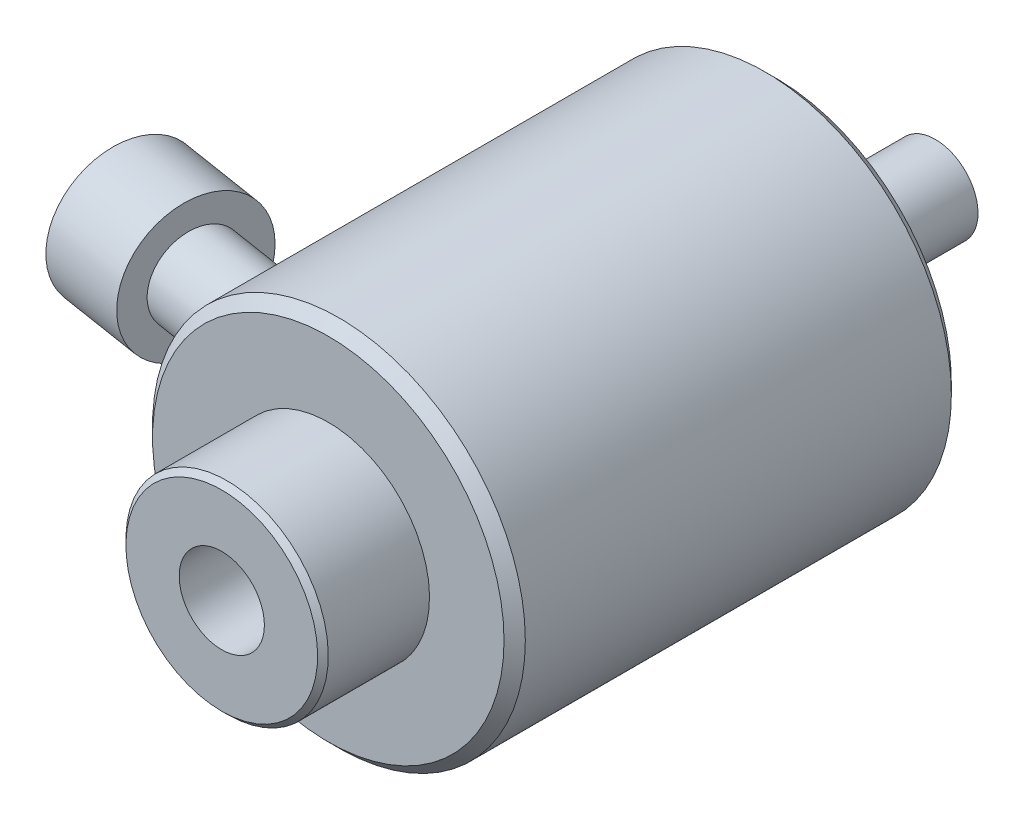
ISO-10303-21;
HEADER;
FILE_DESCRIPTION(('STEP AP214'),'2;1');
FILE_NAME('part.step','',(''),(''),'','','');
FILE_SCHEMA(('AUTOMOTIVE_DESIGN { 1 0 10303 214 1 1 1 1 }'));
ENDSEC;
DATA;
#1=APPLICATION_CONTEXT('core data for automotive mechanical design processes');
#2=APPLICATION_PROTOCOL_DEFINITION('international standard','automotive_design',2000,#1);
#3=PRODUCT_CONTEXT('',#1,'mechanical');
#4=PRODUCT('Part','Part','',(#3));
#5=PRODUCT_RELATED_PRODUCT_CATEGORY('part','',(#4));
#6=PRODUCT_DEFINITION_FORMATION('','',#4);
#7=PRODUCT_DEFINITION_CONTEXT('part definition',#1,'design');
#8=PRODUCT_DEFINITION('design','',#6,#7);
#9=PRODUCT_DEFINITION_SHAPE('','',#8);
#10=(LENGTH_UNIT() NAMED_UNIT(*) SI_UNIT(.MILLI.,.METRE.));
#11=(NAMED_UNIT(*) PLANE_ANGLE_UNIT() SI_UNIT($,.RADIAN.));
#12=(NAMED_UNIT(*) SI_UNIT($,.STERADIAN.) SOLID_ANGLE_UNIT());
#13=UNCERTAINTY_MEASURE_WITH_UNIT(LENGTH_MEASURE(1.E-05),#10,'distance_accuracy_value','');
#14=(GEOMETRIC_REPRESENTATION_CONTEXT(3) GLOBAL_UNCERTAINTY_ASSIGNED_CONTEXT((#13)) GLOBAL_UNIT_ASSIGNED_CONTEXT((#10,
#11,#12)) REPRESENTATION_CONTEXT('',''));
#15=CARTESIAN_POINT('',(0.,0.,0.));
#16=DIRECTION('',(0.,0.,1.));
#17=DIRECTION('',(1.,0.,0.));
#18=AXIS2_PLACEMENT_3D('',#15,#16,#17);
#19=CARTESIAN_POINT('',(-24.5233400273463,0.,8.88761222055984));
#20=DIRECTION('',(-0.987688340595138,0.,-0.156434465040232));
#21=DIRECTION('',(-0.156434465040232,0.,0.987688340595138));
#22=AXIS2_PLACEMENT_3D('',#19,#20,#21);
#23=CYLINDRICAL_SURFACE('',#22,1.25);
#24=CARTESIAN_POINT('',(-17.5,0.,11.265581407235));
#25=CARTESIAN_POINT('',(-17.4999994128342,0.0699765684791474,11.2655783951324));
#26=CARTESIAN_POINT('',(-17.499575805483,0.140001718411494,11.2596792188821));
#27=CARTESIAN_POINT('',(-17.4979265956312,0.278119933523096,11.2362271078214));
#28=CARTESIAN_POINT('',(-17.4967000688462,0.346210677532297,11.2186607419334));
#29=CARTESIAN_POINT('',(-17.493583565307,0.478441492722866,11.1723706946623));
#30=CARTESIAN_POINT('',(-17.491693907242,0.542583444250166,11.1436523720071));
#31=CARTESIAN_POINT('',(-17.4874637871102,0.665111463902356,11.0758775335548));
#32=CARTESIAN_POINT('',(-17.4851234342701,0.723498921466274,11.0368235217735));
#33=CARTESIAN_POINT('',(-17.4802526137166,0.832932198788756,10.9494526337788));
#34=CARTESIAN_POINT('',(-17.4777220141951,0.883972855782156,10.901129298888));
#35=CARTESIAN_POINT('',(-17.4727554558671,0.977243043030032,10.7966139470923));
#36=CARTESIAN_POINT('',(-17.4703195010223,1.01947220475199,10.7404216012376));
#37=CARTESIAN_POINT('',(-17.4658062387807,1.09408364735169,10.6215850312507));
#38=CARTESIAN_POINT('',(-17.4637300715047,1.1264348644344,10.5589212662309));
#39=CARTESIAN_POINT('',(-17.4601750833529,1.18026163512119,10.4290713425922));
#40=CARTESIAN_POINT('',(-17.458696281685,1.20173683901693,10.3618850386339));
#41=CARTESIAN_POINT('',(-17.4564876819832,1.23340768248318,10.22434920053));
#42=CARTESIAN_POINT('',(-17.4557637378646,1.24351521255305,10.1539792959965));
#43=CARTESIAN_POINT('',(-17.455160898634,1.25194887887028,10.0125341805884));
#44=CARTESIAN_POINT('',(-17.4552820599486,1.25027422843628,9.94145892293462));
#45=CARTESIAN_POINT('',(-17.456357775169,1.23516416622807,9.7997397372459));
#46=CARTESIAN_POINT('',(-17.4573220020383,1.22159224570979,9.72911043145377));
#47=CARTESIAN_POINT('',(-17.4599852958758,1.18291416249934,9.59109593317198));
#48=CARTESIAN_POINT('',(-17.4616844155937,1.15780717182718,9.52371097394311));
#49=CARTESIAN_POINT('',(-17.4656428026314,1.09648060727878,9.39349963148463));
#50=CARTESIAN_POINT('',(-17.467906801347,1.06016652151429,9.33071786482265));
#51=CARTESIAN_POINT('',(-17.4727286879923,0.977477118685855,9.21217909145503));
#52=CARTESIAN_POINT('',(-17.4752865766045,0.931101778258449,9.15642210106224));
#53=CARTESIAN_POINT('',(-17.4803911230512,0.829749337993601,9.05382068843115));
#54=CARTESIAN_POINT('',(-17.4829377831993,0.774808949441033,9.00694003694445));
#55=CARTESIAN_POINT('',(-17.4877346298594,0.65769619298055,8.9232805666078));
#56=CARTESIAN_POINT('',(-17.4899848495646,0.595524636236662,8.88650061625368));
#57=CARTESIAN_POINT('',(-17.4938841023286,0.466979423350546,8.82486405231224));
#58=CARTESIAN_POINT('',(-17.4955438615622,0.400709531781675,8.79979180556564));
#59=CARTESIAN_POINT('',(-17.498127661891,0.264837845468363,8.76139083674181));
#60=CARTESIAN_POINT('',(-17.4990518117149,0.195236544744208,8.74806037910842));
#61=CARTESIAN_POINT('',(-17.5000442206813,0.056317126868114,8.73376570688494));
#62=CARTESIAN_POINT('',(-17.5001308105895,-0.0129737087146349,8.73253663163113));
#63=CARTESIAN_POINT('',(-17.4994862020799,-0.150760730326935,8.74179567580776));
#64=CARTESIAN_POINT('',(-17.4987550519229,-0.219256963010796,8.75228310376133));
#65=CARTESIAN_POINT('',(-17.4965662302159,-0.353009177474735,8.78450143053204));
#66=CARTESIAN_POINT('',(-17.495113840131,-0.418284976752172,8.80615063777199));
#67=CARTESIAN_POINT('',(-17.4916459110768,-0.544337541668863,8.85994605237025));
#68=CARTESIAN_POINT('',(-17.4896303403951,-0.605114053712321,8.8920928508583));
#69=CARTESIAN_POINT('',(-17.4852257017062,-0.721326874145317,8.96638177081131));
#70=CARTESIAN_POINT('',(-17.482832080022,-0.77668264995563,9.00864950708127));
#71=CARTESIAN_POINT('',(-17.4779512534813,-0.879707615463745,9.1016897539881));
#72=CARTESIAN_POINT('',(-17.4754640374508,-0.927375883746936,9.15246328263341));
#73=CARTESIAN_POINT('',(-17.4706071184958,-1.01481668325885,9.26232481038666));
#74=CARTESIAN_POINT('',(-17.4682413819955,-1.05438466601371,9.32157583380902));
#75=CARTESIAN_POINT('',(-17.4639515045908,-1.12320577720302,9.44580882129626));
#76=CARTESIAN_POINT('',(-17.4620274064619,-1.15245790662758,9.51079133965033));
#77=CARTESIAN_POINT('',(-17.4588083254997,-1.20024948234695,9.64576831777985));
#78=CARTESIAN_POINT('',(-17.4575238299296,-1.21861123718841,9.71582603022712));
#79=CARTESIAN_POINT('',(-17.4557794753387,-1.24334983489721,9.85803888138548));
#80=CARTESIAN_POINT('',(-17.4553196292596,-1.24972648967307,9.93019405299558));
#81=CARTESIAN_POINT('',(-17.4552817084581,-1.25025635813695,10.074589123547));
#82=CARTESIAN_POINT('',(-17.4557040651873,-1.24440359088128,10.1468290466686));
#83=CARTESIAN_POINT('',(-17.4573880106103,-1.22055111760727,10.2892664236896));
#84=CARTESIAN_POINT('',(-17.4586495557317,-1.20255204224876,10.359463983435));
#85=CARTESIAN_POINT('',(-17.4618527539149,-1.15509903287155,10.4950465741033));
#86=CARTESIAN_POINT('',(-17.4637872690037,-1.12576497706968,10.5604737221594));
#87=CARTESIAN_POINT('',(-17.468118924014,-1.05641964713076,10.6853819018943));
#88=CARTESIAN_POINT('',(-17.4705160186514,-1.0164094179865,10.7448635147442));
#89=CARTESIAN_POINT('',(-17.4754688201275,-0.927335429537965,10.8555034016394));
#90=CARTESIAN_POINT('',(-17.478022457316,-0.878377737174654,10.906747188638));
#91=CARTESIAN_POINT('',(-17.4830223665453,-0.772484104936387,11.0002313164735));
#92=CARTESIAN_POINT('',(-17.485468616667,-0.715546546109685,11.0424698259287));
#93=CARTESIAN_POINT('',(-17.489960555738,-0.595694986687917,11.1164855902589));
#94=CARTESIAN_POINT('',(-17.4920085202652,-0.532818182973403,11.1483230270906));
#95=CARTESIAN_POINT('',(-17.4954880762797,-0.402639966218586,11.2009432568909));
#96=CARTESIAN_POINT('',(-17.4969203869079,-0.335343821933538,11.2217389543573));
#97=CARTESIAN_POINT('',(-17.498633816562,-0.223033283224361,11.2463180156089));
#98=CARTESIAN_POINT('',(-17.4991438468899,-0.178743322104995,11.2535325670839));
#99=CARTESIAN_POINT('',(-17.4998271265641,-0.0896422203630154,11.2631652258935));
#100=CARTESIAN_POINT('',(-17.5000003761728,-0.0448310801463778,11.265583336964));
#101=CARTESIAN_POINT('',(-17.5,0.,11.265581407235));
#102=B_SPLINE_CURVE_WITH_KNOTS('',3,(#24,#25,#26,#27,#28,#29,#30,#31,#32,#33,#34,#35,#36,#37,
#38,#39,#40,#41,#42,#43,#44,#45,#46,#47,#48,#49,#50,#51,#52,#53,#54,#55,#56,#57,#58,#59,#60,#61,
#62,#63,#64,#65,#66,#67,#68,#69,#70,#71,#72,#73,#74,#75,#76,#77,#78,#79,#80,#81,#82,#83,#84,#85,
#86,#87,#88,#89,#90,#91,#92,#93,#94,#95,#96,#97,#98,#99,#100,#101),.UNSPECIFIED.,.T.,.F.,(4,2,2,
2,2,2,2,2,2,2,2,2,2,2,2,2,2,2,2,2,2,2,2,2,2,2,2,2,2,2,2,2,2,2,2,2,2,2,4),(0.,0.209766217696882,
0.419774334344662,0.629681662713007,0.83953818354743,1.04954146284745,1.25955352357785,
1.47021937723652,1.68089200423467,1.89318651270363,2.1054951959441,2.32027226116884,
2.53506474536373,2.75172054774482,2.96837685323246,3.1841288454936,3.39985665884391,
3.61143708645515,3.82298623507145,4.02989467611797,4.23679090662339,4.44219394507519,
4.64760855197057,4.85571841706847,5.06385320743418,5.27672821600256,5.48962383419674,
5.70590384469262,5.9221872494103,6.13857645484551,6.35495442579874,6.56910400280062,
6.78323262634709,6.99497057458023,7.20675154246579,7.41728447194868,7.62757080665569,
7.76195941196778,7.89634791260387),.UNSPECIFIED.);
#103=CARTESIAN_POINT('',(-17.5,0.,11.265581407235));
#104=VERTEX_POINT('',#103);
#105=EDGE_CURVE('P0_E185',#104,#104,#102,.T.);
#106=ORIENTED_EDGE('',*,*,#105,.T.);
#107=EDGE_LOOP('',(#106));
#108=FACE_BOUND('',#107,.T.);
#109=CARTESIAN_POINT('',(-16.5,0.,11.4239658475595));
#110=CARTESIAN_POINT('',(-16.4999993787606,0.0699951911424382,11.423962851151));
#111=CARTESIAN_POINT('',(-16.4995498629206,0.140038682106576,11.418064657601));
#112=CARTESIAN_POINT('',(-16.4977997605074,0.278193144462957,11.3946158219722));
#113=CARTESIAN_POINT('',(-16.4964981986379,0.346301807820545,11.3770518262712));
#114=CARTESIAN_POINT('',(-16.4931909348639,0.478568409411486,11.3307654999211));
#115=CARTESIAN_POINT('',(-16.4911855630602,0.54272818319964,11.3020483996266));
#116=CARTESIAN_POINT('',(-16.4866963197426,0.665289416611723,11.2342721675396));
#117=CARTESIAN_POINT('',(-16.4842125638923,0.72369226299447,11.1952155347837));
#118=CARTESIAN_POINT('',(-16.479043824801,0.833140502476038,11.1078416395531));
#119=CARTESIAN_POINT('',(-16.4763587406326,0.884182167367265,11.0595197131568));
#120=CARTESIAN_POINT('',(-16.4710892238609,0.977449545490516,10.955002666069));
#121=CARTESIAN_POINT('',(-16.4685047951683,1.01967491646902,10.8988072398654));
#122=CARTESIAN_POINT('',(-16.4637180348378,1.09425495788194,10.7799868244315));
#123=CARTESIAN_POINT('',(-16.4615167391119,1.12658304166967,10.7173451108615));
#124=CARTESIAN_POINT('',(-16.4577479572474,1.1803655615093,10.5875403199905));
#125=CARTESIAN_POINT('',(-16.4561804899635,1.20181967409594,10.520377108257));
#126=CARTESIAN_POINT('',(-16.4538404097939,1.23344713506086,10.3829105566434));
#127=CARTESIAN_POINT('',(-16.4530737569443,1.24353594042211,10.312587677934));
#128=CARTESIAN_POINT('',(-16.452435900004,1.25194682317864,10.1712385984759));
#129=CARTESIAN_POINT('',(-16.4525647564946,1.25026810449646,10.1002123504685));
#130=CARTESIAN_POINT('',(-16.453705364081,1.23516681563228,9.95857316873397));
#131=CARTESIAN_POINT('',(-16.4547275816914,1.22160501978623,9.88797515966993));
#132=CARTESIAN_POINT('',(-16.4575505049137,1.18296378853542,9.75001864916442));
#133=CARTESIAN_POINT('',(-16.4593512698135,1.15788347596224,9.68266039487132));
#134=CARTESIAN_POINT('',(-16.4635477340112,1.09660564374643,9.55244569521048));
#135=CARTESIAN_POINT('',(-16.4659488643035,1.06030588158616,9.48963749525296));
#136=CARTESIAN_POINT('',(-16.4710630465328,0.977645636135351,9.37104087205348));
#137=CARTESIAN_POINT('',(-16.4737761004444,0.931285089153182,9.31525249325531));
#138=CARTESIAN_POINT('',(-16.4791919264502,0.829935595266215,9.21255969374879));
#139=CARTESIAN_POINT('',(-16.4818946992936,0.774979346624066,9.16562303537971));
#140=CARTESIAN_POINT('',(-16.4869858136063,0.657821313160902,9.08185948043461));
#141=CARTESIAN_POINT('',(-16.4893741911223,0.595620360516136,9.04503142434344));
#142=CARTESIAN_POINT('',(-16.493511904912,0.467030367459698,8.9833275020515));
#143=CARTESIAN_POINT('',(-16.4952728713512,0.400747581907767,8.95823108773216));
#144=CARTESIAN_POINT('',(-16.4980141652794,0.264842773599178,8.91979335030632));
#145=CARTESIAN_POINT('',(-16.4989946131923,0.195221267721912,8.90645021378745));
#146=CARTESIAN_POINT('',(-16.5000467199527,0.0563212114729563,8.89215223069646));
#147=CARTESIAN_POINT('',(-16.5001386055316,-0.0129289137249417,8.89092164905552));
#148=CARTESIAN_POINT('',(-16.4994560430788,-0.150634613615,8.90017172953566));
#149=CARTESIAN_POINT('',(-16.4986816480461,-0.219090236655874,8.91065167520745));
#150=CARTESIAN_POINT('',(-16.4963635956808,-0.352739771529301,8.94284166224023));
#151=CARTESIAN_POINT('',(-16.4948257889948,-0.417954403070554,8.9644663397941));
#152=CARTESIAN_POINT('',(-16.4911538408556,-0.543891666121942,9.01819495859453));
#153=CARTESIAN_POINT('',(-16.4890196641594,-0.604614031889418,9.05029951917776));
#154=CARTESIAN_POINT('',(-16.4843540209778,-0.7207646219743,9.12450590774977));
#155=CARTESIAN_POINT('',(-16.4818175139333,-0.776108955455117,9.16673862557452));
#156=CARTESIAN_POINT('',(-16.4766443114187,-0.879123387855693,9.25970081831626));
#157=CARTESIAN_POINT('',(-16.4740076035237,-0.926792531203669,9.310431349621));
#158=CARTESIAN_POINT('',(-16.4688551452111,-1.01428840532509,9.42024608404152));
#159=CARTESIAN_POINT('',(-16.4663437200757,-1.05390341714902,9.47949923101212));
#160=CARTESIAN_POINT('',(-16.4617881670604,-1.12282128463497,9.6037445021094));
#161=CARTESIAN_POINT('',(-16.4597440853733,-1.15212312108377,9.66873719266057));
#162=CARTESIAN_POINT('',(-16.4563222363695,-1.20002019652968,9.80375911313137));
#163=CARTESIAN_POINT('',(-16.454955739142,-1.21843526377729,9.87385263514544));
#164=CARTESIAN_POINT('',(-16.4530980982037,-1.24326996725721,10.0161472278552));
#165=CARTESIAN_POINT('',(-16.4526069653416,-1.24968945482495,10.0883483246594));
#166=CARTESIAN_POINT('',(-16.452561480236,-1.25028845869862,10.232800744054));
#167=CARTESIAN_POINT('',(-16.4530070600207,-1.24446886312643,10.3050520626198));
#168=CARTESIAN_POINT('',(-16.4547893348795,-1.22067544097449,10.4475151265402));
#169=CARTESIAN_POINT('',(-16.4561259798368,-1.20270229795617,10.5177269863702));
#170=CARTESIAN_POINT('',(-16.4595206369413,-1.15530702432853,10.653292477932));
#171=CARTESIAN_POINT('',(-16.4615705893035,-1.12601242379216,10.718690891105));
#172=CARTESIAN_POINT('',(-16.4661615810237,-1.0567505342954,10.8435466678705));
#173=CARTESIAN_POINT('',(-16.4687025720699,-1.01678429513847,10.9030046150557));
#174=CARTESIAN_POINT('',(-16.4739531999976,-0.92780591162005,11.0135997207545));
#175=CARTESIAN_POINT('',(-16.4766606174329,-0.878900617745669,11.0648229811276));
#176=CARTESIAN_POINT('',(-16.4819625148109,-0.77311670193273,11.1582786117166));
#177=CARTESIAN_POINT('',(-16.4845569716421,-0.716236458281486,11.2005091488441));
#178=CARTESIAN_POINT('',(-16.4893232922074,-0.596478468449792,11.274540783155));
#179=CARTESIAN_POINT('',(-16.4914974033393,-0.533635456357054,11.3063980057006));
#180=CARTESIAN_POINT('',(-16.495192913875,-0.403520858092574,11.3590703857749));
#181=CARTESIAN_POINT('',(-16.4967150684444,-0.336254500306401,11.379898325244));
#182=CARTESIAN_POINT('',(-16.4985407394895,-0.223821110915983,11.4045783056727));
#183=CARTESIAN_POINT('',(-16.4990855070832,-0.179376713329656,11.411839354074));
#184=CARTESIAN_POINT('',(-16.4998153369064,-0.0899615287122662,11.4215340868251));
#185=CARTESIAN_POINT('',(-16.5000003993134,-0.044990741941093,11.4239677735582));
#186=CARTESIAN_POINT('',(-16.5,0.,11.4239658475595));
#187=B_SPLINE_CURVE_WITH_KNOTS('',3,(#109,#110,#111,#112,#113,#114,#115,#116,#117,#118,#119,
#120,#121,#122,#123,#124,#125,#126,#127,#128,#129,#130,#131,#132,#133,#134,#135,#136,#137,#138,
#139,#140,#141,#142,#143,#144,#145,#146,#147,#148,#149,#150,#151,#152,#153,#154,#155,#156,#157,
#158,#159,#160,#161,#162,#163,#164,#165,#166,#167,#168,#169,#170,#171,#172,#173,#174,#175,#176,
#177,#178,#179,#180,#181,#182,#183,#184,#185,#186),.UNSPECIFIED.,.T.,.F.,(4,2,2,2,2,2,2,2,2,2,2,
2,2,2,2,2,2,2,2,2,2,2,2,2,2,2,2,2,2,2,2,2,2,2,2,2,2,2,4),(0.,0.209821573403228,
0.419883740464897,0.62984751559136,0.839760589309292,1.04977960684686,1.25980677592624,
1.47039327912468,1.68098604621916,1.89313521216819,2.10529873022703,2.31998176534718,
2.53468115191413,2.75139784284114,2.9681159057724,3.1840287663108,3.39991685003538,
3.61156462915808,3.8231797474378,4.02996611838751,4.2367398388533,4.44195279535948,
4.64717788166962,4.85521349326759,5.06327498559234,5.27624854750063,5.4892431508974,
5.70567062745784,5.92210078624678,6.13851524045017,6.35491752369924,6.56895004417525,
6.78296151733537,6.99456480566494,7.20621118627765,7.41669264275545,7.62692963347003,
7.76179651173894,7.89666332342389),.UNSPECIFIED.);
#188=CARTESIAN_POINT('',(-16.5,0.,11.4239658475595));
#189=VERTEX_POINT('',#188);
#190=EDGE_CURVE('P0_E10',#189,#189,#187,.T.);
#191=ORIENTED_EDGE('',*,*,#190,.F.);
#192=EDGE_LOOP('',(#191));
#193=FACE_BOUND('',#192,.T.);
#194=ADVANCED_FACE('P0_F16',(#108,#193),#23,.F.);
#195=CARTESIAN_POINT('',(1.,-15.,26.4226497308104));
#196=DIRECTION('',(1.,0.,0.));
#197=DIRECTION('',(0.,1.,0.));
#198=AXIS2_PLACEMENT_3D('',#195,#196,#197);
#199=PLANE('',#198);
#200=DIRECTION('',(0.,0.,-1.));
#201=VECTOR('',#200,1.);
#202=CARTESIAN_POINT('',(1.,-16.4696690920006,0.));
#203=LINE('',#202,#201);
#204=CARTESIAN_POINT('',(1.,-16.4696690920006,26.4226497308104));
#205=VERTEX_POINT('',#204);
#206=CARTESIAN_POINT('',(1.,-16.4696690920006,27.5773502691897));
#207=VERTEX_POINT('',#206);
#208=EDGE_CURVE('P0_E302',#205,#207,#203,.F.);
#209=ORIENTED_EDGE('',*,*,#208,.F.);
#210=DIRECTION('',(0.,-1.,0.));
#211=VECTOR('',#210,1.);
#212=CARTESIAN_POINT('',(1.,-15.,26.4226497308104));
#213=LINE('',#212,#211);
#214=CARTESIAN_POINT('',(1.,-16.5,26.4226497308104));
#215=VERTEX_POINT('',#214);
#216=EDGE_CURVE('P0_E283',#205,#215,#213,.T.);
#217=ORIENTED_EDGE('',*,*,#216,.T.);
#218=DIRECTION('',(0.,0.,1.));
#219=VECTOR('',#218,1.);
#220=CARTESIAN_POINT('',(1.,-16.5,26.4226497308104));
#221=LINE('',#220,#219);
#222=CARTESIAN_POINT('',(1.,-16.5,27.5773502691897));
#223=VERTEX_POINT('',#222);
#224=EDGE_CURVE('P0_E116',#215,#223,#221,.T.);
#225=ORIENTED_EDGE('',*,*,#224,.T.);
#226=DIRECTION('',(0.,-1.,0.));
#227=VECTOR('',#226,1.);
#228=CARTESIAN_POINT('',(1.,-15.,27.5773502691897));
#229=LINE('',#228,#227);
#230=EDGE_CURVE('P0_E186',#207,#223,#229,.T.);
#231=ORIENTED_EDGE('',*,*,#230,.F.);
#232=EDGE_LOOP('',(#209,#217,#225,#231));
#233=FACE_BOUND('',#232,.T.);
#234=ADVANCED_FACE('P0_F236',(#233),#199,.F.);
#235=CARTESIAN_POINT('',(-1.,-15.,27.5773502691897));
#236=DIRECTION('',(-1.,0.,0.));
#237=DIRECTION('',(0.,0.,-1.));
#238=AXIS2_PLACEMENT_3D('',#235,#236,#237);
#239=PLANE('',#238);
#240=DIRECTION('',(0.,0.,-1.));
#241=VECTOR('',#240,1.);
#242=CARTESIAN_POINT('',(-1.,-16.4696690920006,0.));
#243=LINE('',#242,#241);
#244=CARTESIAN_POINT('',(-1.,-16.4696690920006,27.5773502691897));
#245=VERTEX_POINT('',#244);
#246=CARTESIAN_POINT('',(-1.,-16.4696690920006,26.4226497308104));
#247=VERTEX_POINT('',#246);
#248=EDGE_CURVE('P0_E120',#245,#247,#243,.T.);
#249=ORIENTED_EDGE('',*,*,#248,.F.);
#250=DIRECTION('',(0.,-1.,0.));
#251=VECTOR('',#250,1.);
#252=CARTESIAN_POINT('',(-1.,-15.,27.5773502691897));
#253=LINE('',#252,#251);
#254=CARTESIAN_POINT('',(-1.,-16.5,27.5773502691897));
#255=VERTEX_POINT('',#254);
#256=EDGE_CURVE('P0_E104',#245,#255,#253,.T.);
#257=ORIENTED_EDGE('',*,*,#256,.T.);
#258=DIRECTION('',(0.,0.,-1.));
#259=VECTOR('',#258,1.);
#260=CARTESIAN_POINT('',(-1.,-16.5,27.5773502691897));
#261=LINE('',#260,#259);
#262=CARTESIAN_POINT('',(-1.,-16.5,26.4226497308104));
#263=VERTEX_POINT('',#262);
#264=EDGE_CURVE('P0_E267',#255,#263,#261,.T.);
#265=ORIENTED_EDGE('',*,*,#264,.T.);
#266=DIRECTION('',(0.,-1.,0.));
#267=VECTOR('',#266,1.);
#268=CARTESIAN_POINT('',(-1.,-15.,26.4226497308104));
#269=LINE('',#268,#267);
#270=EDGE_CURVE('P0_E115',#247,#263,#269,.T.);
#271=ORIENTED_EDGE('',*,*,#270,.F.);
#272=EDGE_LOOP('',(#249,#257,#265,#271));
#273=FACE_BOUND('',#272,.T.);
#274=ADVANCED_FACE('P0_F121',(#273),#239,.F.);
#275=CARTESIAN_POINT('',(-7.7644177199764,0.,30.041964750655));
#276=DIRECTION('',(0.987688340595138,0.,0.156434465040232));
#277=DIRECTION('',(0.156434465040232,0.,-0.987688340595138));
#278=AXIS2_PLACEMENT_3D('',#275,#276,#277);
#279=CYLINDRICAL_SURFACE('',#278,4.);
#280=CARTESIAN_POINT('',(-17.5,0.,32.549860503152));
#281=CARTESIAN_POINT('',(-17.4999957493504,0.22461447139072,32.5498539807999));
#282=CARTESIAN_POINT('',(-17.4956327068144,0.449318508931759,32.5313396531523));
#283=CARTESIAN_POINT('',(-17.4786392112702,0.892435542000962,32.4577221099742));
#284=CARTESIAN_POINT('',(-17.466003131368,1.11084415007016,32.4025939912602));
#285=CARTESIAN_POINT('',(-17.4338463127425,1.53500330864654,32.2571782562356));
#286=CARTESIAN_POINT('',(-17.4143281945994,1.74075864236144,32.1669040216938));
#287=CARTESIAN_POINT('',(-17.3705421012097,2.13387663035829,31.9534994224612));
#288=CARTESIAN_POINT('',(-17.3462746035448,2.3212411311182,31.8303723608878));
#289=CARTESIAN_POINT('',(-17.2956371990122,2.67254969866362,31.554214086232));
#290=CARTESIAN_POINT('',(-17.2692645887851,2.8364628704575,31.4011440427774));
#291=CARTESIAN_POINT('',(-17.2174178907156,3.13586762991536,31.0692182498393));
#292=CARTESIAN_POINT('',(-17.1919437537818,3.27136077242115,30.890363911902));
#293=CARTESIAN_POINT('',(-17.1450047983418,3.50904954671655,30.5132847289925));
#294=CARTESIAN_POINT('',(-17.1235096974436,3.61150148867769,30.3152252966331));
#295=CARTESIAN_POINT('',(-17.0867315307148,3.78169775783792,29.9041969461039));
#296=CARTESIAN_POINT('',(-17.071447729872,3.84944619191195,29.6912297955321));
#297=CARTESIAN_POINT('',(-17.0489280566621,3.94798646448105,29.2592561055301));
#298=CARTESIAN_POINT('',(-17.0415966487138,3.97921736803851,29.0403543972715));
#299=CARTESIAN_POINT('',(-17.0353528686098,4.0058631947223,28.6002825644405));
#300=CARTESIAN_POINT('',(-17.0364409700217,4.00127610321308,28.3791123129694));
#301=CARTESIAN_POINT('',(-17.0468237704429,3.95680559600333,27.9380003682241));
#302=CARTESIAN_POINT('',(-17.0562129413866,3.91651584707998,27.7181022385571));
#303=CARTESIAN_POINT('',(-17.0821528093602,3.80177307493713,27.287851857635));
#304=CARTESIAN_POINT('',(-17.0987051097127,3.72731240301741,27.0775017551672));
#305=CARTESIAN_POINT('',(-17.1378795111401,3.54292035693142,26.6635686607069));
#306=CARTESIAN_POINT('',(-17.1607139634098,3.43171388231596,26.460573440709));
#307=CARTESIAN_POINT('',(-17.2095501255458,3.17774497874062,26.0757614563));
#308=CARTESIAN_POINT('',(-17.2355525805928,3.03497511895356,25.8939496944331));
#309=CARTESIAN_POINT('',(-17.2885137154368,2.71731655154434,25.5523458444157));
#310=CARTESIAN_POINT('',(-17.3154801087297,2.54171848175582,25.3932124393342));
#311=CARTESIAN_POINT('',(-17.3665728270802,2.16521302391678,25.1077562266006));
#312=CARTESIAN_POINT('',(-17.3906996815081,1.96431036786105,24.981427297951));
#313=CARTESIAN_POINT('',(-17.4324970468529,1.54923721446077,24.7698430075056));
#314=CARTESIAN_POINT('',(-17.4503460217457,1.33567891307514,24.6834256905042));
#315=CARTESIAN_POINT('',(-17.4784212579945,0.896184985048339,24.5497264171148));
#316=CARTESIAN_POINT('',(-17.4886512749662,0.670255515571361,24.5024251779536));
#317=CARTESIAN_POINT('',(-17.4998301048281,0.227725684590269,24.4508532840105));
#318=CARTESIAN_POINT('',(-17.5013210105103,0.0114294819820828,24.4440688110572));
#319=CARTESIAN_POINT('',(-17.4963048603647,-0.419085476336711,24.4671089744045));
#320=CARTESIAN_POINT('',(-17.489799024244,-0.633304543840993,24.4969280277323));
#321=CARTESIAN_POINT('',(-17.4697946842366,-1.04801423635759,24.5906483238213));
#322=CARTESIAN_POINT('',(-17.4564779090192,-1.24871532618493,24.6536650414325));
#323=CARTESIAN_POINT('',(-17.4243532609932,-1.63704573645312,24.8108094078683));
#324=CARTESIAN_POINT('',(-17.4055445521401,-1.8246730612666,24.9049417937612));
#325=CARTESIAN_POINT('',(-17.3635294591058,-2.18924524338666,25.1252195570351));
#326=CARTESIAN_POINT('',(-17.3401852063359,-2.36553057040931,25.2524280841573));
#327=CARTESIAN_POINT('',(-17.2919524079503,-2.6956001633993,25.5330478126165));
#328=CARTESIAN_POINT('',(-17.2670633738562,-2.84937725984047,25.6864673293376));
#329=CARTESIAN_POINT('',(-17.2166804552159,-3.13990421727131,26.0255416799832));
#330=CARTESIAN_POINT('',(-17.1912429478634,-3.27503349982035,26.2125956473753));
#331=CARTESIAN_POINT('',(-17.144170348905,-3.51314694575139,26.6066225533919));
#332=CARTESIAN_POINT('',(-17.1225360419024,-3.6161244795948,26.8135995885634));
#333=CARTESIAN_POINT('',(-17.0850498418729,-3.78935161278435,27.2478052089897));
#334=CARTESIAN_POINT('',(-17.0693664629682,-3.85866112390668,27.4754252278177));
#335=CARTESIAN_POINT('',(-17.046655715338,-3.95779784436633,27.9395346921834));
#336=CARTESIAN_POINT('',(-17.0396266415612,-3.98763283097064,28.176022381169));
#337=CARTESIAN_POINT('',(-17.0353470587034,-4.00587500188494,28.6441743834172));
#338=CARTESIAN_POINT('',(-17.0378324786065,-3.9954009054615,28.875792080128));
#339=CARTESIAN_POINT('',(-17.0518556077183,-3.93512027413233,29.3335629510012));
#340=CARTESIAN_POINT('',(-17.0633912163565,-3.88532286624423,29.559717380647));
#341=CARTESIAN_POINT('',(-17.0936083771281,-3.75008091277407,29.9911728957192));
#342=CARTESIAN_POINT('',(-17.1120042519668,-3.66605044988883,30.1969386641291));
#343=CARTESIAN_POINT('',(-17.1538823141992,-3.46479928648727,30.5909656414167));
#344=CARTESIAN_POINT('',(-17.1773642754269,-3.34758006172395,30.7792276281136));
#345=CARTESIAN_POINT('',(-17.2266034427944,-3.08413874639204,31.131891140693));
#346=CARTESIAN_POINT('',(-17.2523445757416,-2.93811357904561,31.2964422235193));
#347=CARTESIAN_POINT('',(-17.3034160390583,-2.6206100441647,31.5989454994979));
#348=CARTESIAN_POINT('',(-17.3287462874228,-2.44912666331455,31.7368924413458));
#349=CARTESIAN_POINT('',(-17.3765824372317,-2.08299901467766,31.9843622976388));
#350=CARTESIAN_POINT('',(-17.3990460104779,-1.88807553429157,32.0934801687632));
#351=CARTESIAN_POINT('',(-17.4382827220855,-1.48246254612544,32.2780292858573));
#352=CARTESIAN_POINT('',(-17.4550595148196,-1.27178326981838,32.3534821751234));
#353=CARTESIAN_POINT('',(-17.4784899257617,-0.8843707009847,32.4571671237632));
#354=CARTESIAN_POINT('',(-17.4865066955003,-0.709420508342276,32.4918731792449));
#355=CARTESIAN_POINT('',(-17.4972634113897,-0.356332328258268,32.5382224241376));
#356=CARTESIAN_POINT('',(-17.5000033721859,-0.178194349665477,32.5498656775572));
#357=CARTESIAN_POINT('',(-17.5,0.,32.549860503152));
#358=B_SPLINE_CURVE_WITH_KNOTS('',3,(#280,#281,#282,#283,#284,#285,#286,#287,#288,#289,#290,
#291,#292,#293,#294,#295,#296,#297,#298,#299,#300,#301,#302,#303,#304,#305,#306,#307,#308,#309,
#310,#311,#312,#313,#314,#315,#316,#317,#318,#319,#320,#321,#322,#323,#324,#325,#326,#327,#328,
#329,#330,#331,#332,#333,#334,#335,#336,#337,#338,#339,#340,#341,#342,#343,#344,#345,#346,#347,
#348,#349,#350,#351,#352,#353,#354,#355,#356,#357),.UNSPECIFIED.,.T.,.F.,(4,2,2,2,2,2,2,2,2,2,2,
2,2,2,2,2,2,2,2,2,2,2,2,2,2,2,2,2,2,2,2,2,2,2,2,2,2,2,4),(0.,0.673201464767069,1.34686128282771,
2.02026485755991,2.6936007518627,3.36781569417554,4.0419937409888,4.71080864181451,
5.37954437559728,6.04015414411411,6.70080106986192,7.36906481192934,8.03747820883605,
8.73207239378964,9.42683027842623,10.1388354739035,10.8507077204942,11.5402958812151,
12.2295438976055,12.8755434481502,13.5214444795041,14.150946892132,14.7805451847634,
15.433628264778,16.0869189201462,16.7802373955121,17.4736987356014,18.1855455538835,
18.8972521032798,19.5893506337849,20.2812885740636,20.9471508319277,21.61298348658,
22.2744129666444,22.9359728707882,23.6063851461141,24.2763657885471,24.8104410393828,
25.3445148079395),.UNSPECIFIED.);
#359=CARTESIAN_POINT('',(-17.5,0.,32.549860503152));
#360=VERTEX_POINT('',#359);
#361=EDGE_CURVE('P0_E204',#360,#360,#358,.T.);
#362=ORIENTED_EDGE('',*,*,#361,.T.);
#363=EDGE_LOOP('',(#362));
#364=FACE_BOUND('',#363,.T.);
#365=CARTESIAN_POINT('',(-27.5181845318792,0.,26.9132754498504));
#366=DIRECTION('',(0.987688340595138,0.,0.156434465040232));
#367=DIRECTION('',(0.156434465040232,0.,-0.987688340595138));
#368=AXIS2_PLACEMENT_3D('',#365,#366,#367);
#369=CIRCLE('',#368,4.);
#370=CARTESIAN_POINT('',(-26.8924466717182,0.,22.9625220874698));
#371=VERTEX_POINT('',#370);
#372=EDGE_CURVE('P0_E132',#371,#371,#369,.T.);
#373=ORIENTED_EDGE('',*,*,#372,.T.);
#374=EDGE_LOOP('',(#373));
#375=FACE_BOUND('',#374,.T.);
#376=ADVANCED_FACE('P0_F18',(#364,#375),#279,.T.);
#377=CARTESIAN_POINT('',(-26.8924466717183,0.,22.9625220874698));
#378=DIRECTION('',(0.987688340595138,0.,0.156434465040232));
#379=DIRECTION('',(0.156434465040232,0.,-0.987688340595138));
#380=AXIS2_PLACEMENT_3D('',#377,#378,#379);
#381=PLANE('',#380);
#382=CARTESIAN_POINT('',(-27.5181845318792,0.,26.9132754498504));
#383=DIRECTION('',(0.987688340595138,0.,0.156434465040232));
#384=DIRECTION('',(0.156434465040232,0.,-0.987688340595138));
#385=AXIS2_PLACEMENT_3D('',#382,#383,#384);
#386=CIRCLE('',#385,6.5);
#387=CARTESIAN_POINT('',(-26.5013605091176,0.,20.493301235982));
#388=VERTEX_POINT('',#387);
#389=EDGE_CURVE('P0_E139',#388,#388,#386,.T.);
#390=ORIENTED_EDGE('',*,*,#389,.T.);
#391=EDGE_LOOP('',(#390));
#392=FACE_BOUND('',#391,.T.);
#393=ORIENTED_EDGE('',*,*,#372,.F.);
#394=EDGE_LOOP('',(#393));
#395=FACE_BOUND('',#394,.T.);
#396=ADVANCED_FACE('P0_F387',(#392,#395),#381,.T.);
#397=CARTESIAN_POINT('',(-7.7644177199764,0.,30.041964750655));
#398=DIRECTION('',(0.987688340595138,0.,0.156434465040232));
#399=DIRECTION('',(0.156434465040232,0.,-0.987688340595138));
#400=AXIS2_PLACEMENT_3D('',#397,#398,#399);
#401=CYLINDRICAL_SURFACE('',#400,6.5);
#402=CARTESIAN_POINT('',(-35.4196912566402,0.,25.6617997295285));
#403=DIRECTION('',(0.987688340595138,0.,0.156434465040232));
#404=DIRECTION('',(0.156434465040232,0.,-0.987688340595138));
#405=AXIS2_PLACEMENT_3D('',#402,#403,#404);
#406=CIRCLE('',#405,6.5);
#407=CARTESIAN_POINT('',(-34.4028672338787,0.,19.2418255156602));
#408=VERTEX_POINT('',#407);
#409=EDGE_CURVE('P0_E380',#408,#408,#406,.T.);
#410=ORIENTED_EDGE('',*,*,#409,.T.);
#411=EDGE_LOOP('',(#410));
#412=FACE_BOUND('',#411,.T.);
#413=ORIENTED_EDGE('',*,*,#389,.F.);
#414=EDGE_LOOP('',(#413));
#415=FACE_BOUND('',#414,.T.);
#416=ADVANCED_FACE('P0_F390',(#412,#415),#401,.T.);
#417=CARTESIAN_POINT('',(-34.4028672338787,0.,19.2418255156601));
#418=DIRECTION('',(-0.987688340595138,0.,-0.156434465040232));
#419=DIRECTION('',(-0.156434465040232,0.,0.987688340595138));
#420=AXIS2_PLACEMENT_3D('',#417,#418,#419);
#421=PLANE('',#420);
#422=DIRECTION('',(-0.135476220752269,-0.5,0.855363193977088));
#423=VECTOR('',#422,1.);
#424=CARTESIAN_POINT('',(-34.9503878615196,-1.73205080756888,22.6987347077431));
#425=LINE('',#424,#423);
#426=CARTESIAN_POINT('',(-34.9503878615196,-1.73205080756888,22.6987347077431));
#427=VERTEX_POINT('',#426);
#428=CARTESIAN_POINT('',(-35.4196912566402,-3.46410161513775,25.6617997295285));
#429=VERTEX_POINT('',#428);
#430=EDGE_CURVE('P0_E319',#427,#429,#425,.T.);
#431=ORIENTED_EDGE('',*,*,#430,.F.);
#432=DIRECTION('',(0.,-1.,0.));
#433=VECTOR('',#432,1.);
#434=CARTESIAN_POINT('',(-34.9503878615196,1.73205080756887,22.6987347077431));
#435=LINE('',#434,#433);
#436=CARTESIAN_POINT('',(-34.9503878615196,1.73205080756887,22.6987347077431));
#437=VERTEX_POINT('',#436);
#438=EDGE_CURVE('P0_E322',#437,#427,#435,.T.);
#439=ORIENTED_EDGE('',*,*,#438,.F.);
#440=DIRECTION('',(-0.135476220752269,0.5,0.855363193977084));
#441=VECTOR('',#440,1.);
#442=CARTESIAN_POINT('',(-34.9503878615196,1.73205080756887,22.6987347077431));
#443=LINE('',#442,#441);
#444=CARTESIAN_POINT('',(-35.4196912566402,3.46410161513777,25.6617997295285));
#445=VERTEX_POINT('',#444);
#446=EDGE_CURVE('P0_E320',#437,#445,#443,.T.);
#447=ORIENTED_EDGE('',*,*,#446,.T.);
#448=DIRECTION('',(0.135476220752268,0.5,-0.855363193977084));
#449=VECTOR('',#448,1.);
#450=CARTESIAN_POINT('',(-35.888994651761,1.73205080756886,28.6248647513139));
#451=LINE('',#450,#449);
#452=CARTESIAN_POINT('',(-35.888994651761,1.73205080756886,28.6248647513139));
#453=VERTEX_POINT('',#452);
#454=EDGE_CURVE('P0_E323',#453,#445,#451,.T.);
#455=ORIENTED_EDGE('',*,*,#454,.F.);
#456=DIRECTION('',(0.,-1.,0.));
#457=VECTOR('',#456,1.);
#458=CARTESIAN_POINT('',(-35.888994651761,1.73205080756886,28.6248647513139));
#459=LINE('',#458,#457);
#460=CARTESIAN_POINT('',(-35.888994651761,-1.73205080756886,28.6248647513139));
#461=VERTEX_POINT('',#460);
#462=EDGE_CURVE('P0_E452',#453,#461,#459,.T.);
#463=ORIENTED_EDGE('',*,*,#462,.T.);
#464=DIRECTION('',(0.135476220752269,-0.5,-0.855363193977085));
#465=VECTOR('',#464,1.);
#466=CARTESIAN_POINT('',(-35.888994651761,-1.73205080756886,28.6248647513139));
#467=LINE('',#466,#465);
#468=EDGE_CURVE('P0_E326',#461,#429,#467,.T.);
#469=ORIENTED_EDGE('',*,*,#468,.T.);
#470=EDGE_LOOP('',(#431,#439,#447,#455,#463,#469));
#471=FACE_BOUND('',#470,.T.);
#472=ORIENTED_EDGE('',*,*,#409,.F.);
#473=EDGE_LOOP('',(#472));
#474=FACE_BOUND('',#473,.T.);
#475=ADVANCED_FACE('P0_F392',(#471,#474),#421,.T.);
#476=CARTESIAN_POINT('',(-30.999634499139,-1.73205080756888,23.324472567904));
#477=DIRECTION('',(0.0782172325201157,-0.86602540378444,-0.493844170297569));
#478=DIRECTION('',(0.135476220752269,0.5,-0.855363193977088));
#479=AXIS2_PLACEMENT_3D('',#476,#477,#478);
#480=PLANE('',#479);
#481=DIRECTION('',(-0.987688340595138,0.,-0.156434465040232));
#482=VECTOR('',#481,1.);
#483=CARTESIAN_POINT('',(-30.999634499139,-1.73205080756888,23.324472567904));
#484=LINE('',#483,#482);
#485=CARTESIAN_POINT('',(-30.999634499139,-1.73205080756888,23.324472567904));
#486=VERTEX_POINT('',#485);
#487=EDGE_CURVE('P0_E377',#486,#427,#484,.T.);
#488=ORIENTED_EDGE('',*,*,#487,.T.);
#489=ORIENTED_EDGE('',*,*,#430,.T.);
#490=DIRECTION('',(-0.987688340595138,0.,-0.156434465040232));
#491=VECTOR('',#490,1.);
#492=CARTESIAN_POINT('',(-31.4689378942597,-3.46410161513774,26.2875375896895));
#493=LINE('',#492,#491);
#494=CARTESIAN_POINT('',(-31.4689378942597,-3.46410161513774,26.2875375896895));
#495=VERTEX_POINT('',#494);
#496=EDGE_CURVE('P0_E367',#495,#429,#493,.T.);
#497=ORIENTED_EDGE('',*,*,#496,.F.);
#498=DIRECTION('',(-0.135476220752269,-0.5,0.855363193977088));
#499=VECTOR('',#498,1.);
#500=CARTESIAN_POINT('',(-30.999634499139,-1.73205080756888,23.324472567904));
#501=LINE('',#500,#499);
#502=EDGE_CURVE('P0_E345',#486,#495,#501,.T.);
#503=ORIENTED_EDGE('',*,*,#502,.F.);
#504=EDGE_LOOP('',(#488,#489,#497,#503));
#505=FACE_BOUND('',#504,.T.);
#506=ADVANCED_FACE('P0_F399',(#505),#480,.F.);
#507=CARTESIAN_POINT('',(-30.999634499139,1.73205080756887,23.324472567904));
#508=DIRECTION('',(0.156434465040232,0.,-0.987688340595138));
#509=DIRECTION('',(0.,1.,0.));
#510=AXIS2_PLACEMENT_3D('',#507,#508,#509);
#511=PLANE('',#510);
#512=DIRECTION('',(-0.987688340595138,0.,-0.156434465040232));
#513=VECTOR('',#512,1.);
#514=CARTESIAN_POINT('',(-30.999634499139,1.73205080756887,23.324472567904));
#515=LINE('',#514,#513);
#516=CARTESIAN_POINT('',(-30.999634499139,1.73205080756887,23.324472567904));
#517=VERTEX_POINT('',#516);
#518=EDGE_CURVE('P0_E340',#517,#437,#515,.T.);
#519=ORIENTED_EDGE('',*,*,#518,.T.);
#520=ORIENTED_EDGE('',*,*,#438,.T.);
#521=ORIENTED_EDGE('',*,*,#487,.F.);
#522=DIRECTION('',(0.,-1.,0.));
#523=VECTOR('',#522,1.);
#524=CARTESIAN_POINT('',(-30.999634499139,1.73205080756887,23.324472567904));
#525=LINE('',#524,#523);
#526=EDGE_CURVE('P0_E364',#517,#486,#525,.T.);
#527=ORIENTED_EDGE('',*,*,#526,.F.);
#528=EDGE_LOOP('',(#519,#520,#521,#527));
#529=FACE_BOUND('',#528,.T.);
#530=ADVANCED_FACE('P0_F403',(#529),#511,.F.);
#531=CARTESIAN_POINT('',(-30.999634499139,1.73205080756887,23.324472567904));
#532=DIRECTION('',(-0.0782172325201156,-0.866025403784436,0.493844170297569));
#533=DIRECTION('',(0.135476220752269,-0.5,-0.855363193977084));
#534=AXIS2_PLACEMENT_3D('',#531,#532,#533);
#535=PLANE('',#534);
#536=DIRECTION('',(-0.987688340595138,0.,-0.156434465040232));
#537=VECTOR('',#536,1.);
#538=CARTESIAN_POINT('',(-31.4689378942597,3.46410161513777,26.2875375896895));
#539=LINE('',#538,#537);
#540=CARTESIAN_POINT('',(-31.4689378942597,3.46410161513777,26.2875375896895));
#541=VERTEX_POINT('',#540);
#542=EDGE_CURVE('P0_E338',#541,#445,#539,.T.);
#543=ORIENTED_EDGE('',*,*,#542,.T.);
#544=ORIENTED_EDGE('',*,*,#446,.F.);
#545=ORIENTED_EDGE('',*,*,#518,.F.);
#546=DIRECTION('',(-0.135476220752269,0.5,0.855363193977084));
#547=VECTOR('',#546,1.);
#548=CARTESIAN_POINT('',(-30.999634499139,1.73205080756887,23.324472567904));
#549=LINE('',#548,#547);
#550=EDGE_CURVE('P0_E360',#517,#541,#549,.T.);
#551=ORIENTED_EDGE('',*,*,#550,.T.);
#552=EDGE_LOOP('',(#543,#544,#545,#551));
#553=FACE_BOUND('',#552,.T.);
#554=ADVANCED_FACE('P0_F406',(#553),#535,.T.);
#555=CARTESIAN_POINT('',(-31.9382412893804,1.73205080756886,29.2506026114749));
#556=DIRECTION('',(-0.0782172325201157,0.866025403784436,0.493844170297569));
#557=DIRECTION('',(-0.135476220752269,-0.5,0.855363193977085));
#558=AXIS2_PLACEMENT_3D('',#555,#556,#557);
#559=PLANE('',#558);
#560=DIRECTION('',(-0.987688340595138,0.,-0.156434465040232));
#561=VECTOR('',#560,1.);
#562=CARTESIAN_POINT('',(-31.9382412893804,1.73205080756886,29.2506026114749));
#563=LINE('',#562,#561);
#564=CARTESIAN_POINT('',(-31.9382412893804,1.73205080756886,29.2506026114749));
#565=VERTEX_POINT('',#564);
#566=EDGE_CURVE('P0_E341',#565,#453,#563,.T.);
#567=ORIENTED_EDGE('',*,*,#566,.T.);
#568=ORIENTED_EDGE('',*,*,#454,.T.);
#569=ORIENTED_EDGE('',*,*,#542,.F.);
#570=DIRECTION('',(0.135476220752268,0.5,-0.855363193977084));
#571=VECTOR('',#570,1.);
#572=CARTESIAN_POINT('',(-31.9382412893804,1.73205080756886,29.2506026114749));
#573=LINE('',#572,#571);
#574=EDGE_CURVE('P0_E336',#565,#541,#573,.T.);
#575=ORIENTED_EDGE('',*,*,#574,.F.);
#576=EDGE_LOOP('',(#567,#568,#569,#575));
#577=FACE_BOUND('',#576,.T.);
#578=ADVANCED_FACE('P0_F409',(#577),#559,.F.);
#579=CARTESIAN_POINT('',(-31.9382412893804,1.73205080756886,29.2506026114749));
#580=DIRECTION('',(0.156434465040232,0.,-0.987688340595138));
#581=DIRECTION('',(0.,1.,0.));
#582=AXIS2_PLACEMENT_3D('',#579,#580,#581);
#583=PLANE('',#582);
#584=DIRECTION('',(-0.987688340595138,0.,-0.156434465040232));
#585=VECTOR('',#584,1.);
#586=CARTESIAN_POINT('',(-31.9382412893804,-1.73205080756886,29.2506026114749));
#587=LINE('',#586,#585);
#588=CARTESIAN_POINT('',(-31.9382412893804,-1.73205080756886,29.2506026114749));
#589=VERTEX_POINT('',#588);
#590=EDGE_CURVE('P0_E370',#589,#461,#587,.T.);
#591=ORIENTED_EDGE('',*,*,#590,.T.);
#592=ORIENTED_EDGE('',*,*,#462,.F.);
#593=ORIENTED_EDGE('',*,*,#566,.F.);
#594=DIRECTION('',(0.,-1.,0.));
#595=VECTOR('',#594,1.);
#596=CARTESIAN_POINT('',(-31.9382412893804,1.73205080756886,29.2506026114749));
#597=LINE('',#596,#595);
#598=EDGE_CURVE('P0_E333',#565,#589,#597,.T.);
#599=ORIENTED_EDGE('',*,*,#598,.T.);
#600=EDGE_LOOP('',(#591,#592,#593,#599));
#601=FACE_BOUND('',#600,.T.);
#602=ADVANCED_FACE('P0_F413',(#601),#583,.T.);
#603=CARTESIAN_POINT('',(-31.9382412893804,-1.73205080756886,29.2506026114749));
#604=DIRECTION('',(0.0782172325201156,0.866025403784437,-0.493844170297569));
#605=DIRECTION('',(-0.135476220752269,0.5,0.855363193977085));
#606=AXIS2_PLACEMENT_3D('',#603,#604,#605);
#607=PLANE('',#606);
#608=DIRECTION('',(0.135476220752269,-0.5,-0.855363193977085));
#609=VECTOR('',#608,1.);
#610=CARTESIAN_POINT('',(-31.9382412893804,-1.73205080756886,29.2506026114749));
#611=LINE('',#610,#609);
#612=EDGE_CURVE('P0_E310',#589,#495,#611,.T.);
#613=ORIENTED_EDGE('',*,*,#612,.T.);
#614=ORIENTED_EDGE('',*,*,#496,.T.);
#615=ORIENTED_EDGE('',*,*,#468,.F.);
#616=ORIENTED_EDGE('',*,*,#590,.F.);
#617=EDGE_LOOP('',(#613,#614,#615,#616));
#618=FACE_BOUND('',#617,.T.);
#619=ADVANCED_FACE('P0_F170',(#618),#607,.T.);
#620=CARTESIAN_POINT('',(-30.5303311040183,0.,20.3614075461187));
#621=DIRECTION('',(-0.987688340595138,0.,-0.156434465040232));
#622=DIRECTION('',(-0.156434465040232,0.,0.987688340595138));
#623=AXIS2_PLACEMENT_3D('',#620,#621,#622);
#624=PLANE('',#623);
#625=ORIENTED_EDGE('',*,*,#502,.T.);
#626=ORIENTED_EDGE('',*,*,#612,.F.);
#627=ORIENTED_EDGE('',*,*,#598,.F.);
#628=ORIENTED_EDGE('',*,*,#574,.T.);
#629=ORIENTED_EDGE('',*,*,#550,.F.);
#630=ORIENTED_EDGE('',*,*,#526,.T.);
#631=EDGE_LOOP('',(#625,#626,#627,#628,#629,#630));
#632=FACE_BOUND('',#631,.T.);
#633=ADVANCED_FACE('P0_F169',(#632),#624,.T.);
#634=CARTESIAN_POINT('',(0.,-7.5,27.));
#635=DIRECTION('',(0.,-1.,0.));
#636=DIRECTION('',(0.,0.,-1.));
#637=AXIS2_PLACEMENT_3D('',#634,#635,#636);
#638=CYLINDRICAL_SURFACE('',#637,2.);
#639=CARTESIAN_POINT('',(0.,-16.5,25.));
#640=CARTESIAN_POINT('',(0.397538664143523,-16.5,25.));
#641=CARTESIAN_POINT('',(0.765366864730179,-16.5,25.1522409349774));
#642=CARTESIAN_POINT('',(1.13244264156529,-16.5,25.3041704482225));
#643=CARTESIAN_POINT('',(1.41421356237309,-16.5,25.5857864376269));
#644=CARTESIAN_POINT('',(1.69520645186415,-16.5,25.8666248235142));
#645=CARTESIAN_POINT('',(1.84775906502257,-16.5,26.2346331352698));
#646=CARTESIAN_POINT('',(1.99989044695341,-16.5,26.6016252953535));
#647=CARTESIAN_POINT('',(2.,-16.5,27.));
#648=CARTESIAN_POINT('',(2.00010925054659,-16.5,27.3972747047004));
#649=CARTESIAN_POINT('',(1.84775906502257,-16.5,27.7653668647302));
#650=CARTESIAN_POINT('',(1.69582955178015,-16.5,28.1324426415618));
#651=CARTESIAN_POINT('',(1.41421356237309,-16.5,28.4142135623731));
#652=CARTESIAN_POINT('',(1.1333751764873,-16.5,28.6952064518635));
#653=CARTESIAN_POINT('',(0.76536686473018,-16.5,28.8477590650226));
#654=CARTESIAN_POINT('',(0.583907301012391,-16.5,28.9229805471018));
#655=CARTESIAN_POINT('',(0.390180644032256,-16.5,28.9615705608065));
#656=CARTESIAN_POINT('',(0.197260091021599,-16.5,29.));
#657=CARTESIAN_POINT('',(0.,-16.5,29.));
#658=B_SPLINE_CURVE_WITH_KNOTS('',2,(#639,#640,#641,#642,#643,#644,#645,#646,#647,#648,#649,
#650,#651,#652,#653,#654,#655,#656,#657),.UNSPECIFIED.,.F.,.F.,(3,2,2,2,2,2,2,2,2,3),(0.,0.125,
0.25,0.375,0.5,0.625,0.75,0.875,0.9375,1.),.UNSPECIFIED.);
#659=CARTESIAN_POINT('',(0.,-16.5,25.));
#660=VERTEX_POINT('',#659);
#661=CARTESIAN_POINT('',(0.,-16.5,29.));
#662=VERTEX_POINT('',#661);
#663=EDGE_CURVE('P0_E144',#660,#662,#658,.T.);
#664=ORIENTED_EDGE('',*,*,#663,.F.);
#665=CARTESIAN_POINT('',(0.,-16.5,27.));
#666=DIRECTION('',(0.,-1.,0.));
#667=DIRECTION('',(0.,0.,-1.));
#668=AXIS2_PLACEMENT_3D('',#665,#666,#667);
#669=CIRCLE('',#668,2.);
#670=EDGE_CURVE('P0_E33',#662,#660,#669,.T.);
#671=ORIENTED_EDGE('',*,*,#670,.F.);
#672=EDGE_LOOP('',(#664,#671));
#673=FACE_BOUND('',#672,.T.);
#674=CARTESIAN_POINT('',(0.,-17.5,25.));
#675=CARTESIAN_POINT('',(-0.111949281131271,-17.4999985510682,25.0000048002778));
#676=CARTESIAN_POINT('',(-0.223970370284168,-17.4989143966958,25.0094311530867));
#677=CARTESIAN_POINT('',(-0.444900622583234,-17.4946937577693,25.0468888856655));
#678=CARTESIAN_POINT('',(-0.553806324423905,-17.4915550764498,25.0749401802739));
#679=CARTESIAN_POINT('',(-0.765274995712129,-17.4835792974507,25.1488150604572));
#680=CARTESIAN_POINT('',(-0.867841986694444,-17.4787432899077,25.1946272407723));
#681=CARTESIAN_POINT('',(-1.06381060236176,-17.4679120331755,25.3026997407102));
#682=CARTESIAN_POINT('',(-1.15721390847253,-17.4619169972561,25.3649570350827));
#683=CARTESIAN_POINT('',(-1.33265783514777,-17.4494069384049,25.5044617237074));
#684=CARTESIAN_POINT('',(-1.41464987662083,-17.4428898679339,25.5817700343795));
#685=CARTESIAN_POINT('',(-1.5645257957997,-17.4300869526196,25.7490517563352));
#686=CARTESIAN_POINT('',(-1.63240898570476,-17.4238011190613,25.8390257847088));
#687=CARTESIAN_POINT('',(-1.75231750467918,-17.4121519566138,26.029395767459));
#688=CARTESIAN_POINT('',(-1.80429797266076,-17.4067912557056,26.129820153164));
#689=CARTESIAN_POINT('',(-1.89063905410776,-17.3976257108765,26.3380439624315));
#690=CARTESIAN_POINT('',(-1.9250002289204,-17.3938208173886,26.4458431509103));
#691=CARTESIAN_POINT('',(-1.97498120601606,-17.3882168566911,26.6652558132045));
#692=CARTESIAN_POINT('',(-1.99068245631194,-17.3864090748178,26.7768505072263));
#693=CARTESIAN_POINT('',(-2.00314979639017,-17.3849772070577,27.0011045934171));
#694=CARTESIAN_POINT('',(-1.99991652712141,-17.3853530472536,27.1137639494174));
#695=CARTESIAN_POINT('',(-1.9746735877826,-17.3882379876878,27.3363845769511));
#696=CARTESIAN_POINT('',(-1.95275327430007,-17.3907369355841,27.4463561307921));
#697=CARTESIAN_POINT('',(-1.89089772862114,-17.3975706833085,27.6610493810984));
#698=CARTESIAN_POINT('',(-1.85096218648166,-17.4019055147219,27.7657709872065));
#699=CARTESIAN_POINT('',(-1.7541125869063,-17.4119342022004,27.9672714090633));
#700=CARTESIAN_POINT('',(-1.69715932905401,-17.4176311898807,28.0640312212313));
#701=CARTESIAN_POINT('',(-1.56791908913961,-17.4297397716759,28.2466532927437));
#702=CARTESIAN_POINT('',(-1.49563152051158,-17.4361513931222,28.3325151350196));
#703=CARTESIAN_POINT('',(-1.33727766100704,-17.4490120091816,28.4914228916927));
#704=CARTESIAN_POINT('',(-1.25113428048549,-17.455461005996,28.5643920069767));
#705=CARTESIAN_POINT('',(-1.06778054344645,-17.4676349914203,28.6948462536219));
#706=CARTESIAN_POINT('',(-0.970570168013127,-17.4733599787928,28.752331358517));
#707=CARTESIAN_POINT('',(-0.767785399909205,-17.4834436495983,28.8501844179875));
#708=CARTESIAN_POINT('',(-0.662208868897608,-17.487801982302,28.8905479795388));
#709=CARTESIAN_POINT('',(-0.445716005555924,-17.4946579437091,28.9529533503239));
#710=CARTESIAN_POINT('',(-0.334799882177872,-17.4971556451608,28.9749958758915));
#711=CARTESIAN_POINT('',(-0.111440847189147,-17.4999995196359,29.0000348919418));
#712=CARTESIAN_POINT('',(0.00099004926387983,-17.5003576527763,29.0031372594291));
#713=CARTESIAN_POINT('',(0.224770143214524,-17.4989142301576,28.9904867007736));
#714=CARTESIAN_POINT('',(0.33611935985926,-17.4971127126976,28.9747341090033));
#715=CARTESIAN_POINT('',(0.554265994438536,-17.4915599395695,28.9249086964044));
#716=CARTESIAN_POINT('',(0.661074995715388,-17.4878140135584,28.890885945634));
#717=CARTESIAN_POINT('',(0.867470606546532,-17.4787921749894,28.8055377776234));
#718=CARTESIAN_POINT('',(0.967057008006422,-17.4735162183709,28.7542118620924));
#719=CARTESIAN_POINT('',(1.1566560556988,-17.4619935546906,28.6354552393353));
#720=CARTESIAN_POINT('',(1.24662524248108,-17.4557427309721,28.5679555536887));
#721=CARTESIAN_POINT('',(1.41399482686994,-17.4429836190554,28.4188656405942));
#722=CARTESIAN_POINT('',(1.49139480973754,-17.4364753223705,28.3372749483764));
#723=CARTESIAN_POINT('',(1.63180089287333,-17.4238982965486,28.1618546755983));
#724=CARTESIAN_POINT('',(1.69473712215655,-17.4178317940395,28.0679689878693));
#725=CARTESIAN_POINT('',(1.80394755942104,-17.4068606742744,27.8708980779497));
#726=CARTESIAN_POINT('',(1.85022205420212,-17.4019560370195,27.7677130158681));
#727=CARTESIAN_POINT('',(1.92468057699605,-17.3938786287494,27.5552042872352));
#728=CARTESIAN_POINT('',(1.9529049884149,-17.3907019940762,27.4458949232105));
#729=CARTESIAN_POINT('',(1.99059267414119,-17.3864287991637,27.2240499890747));
#730=CARTESIAN_POINT('',(2.00005666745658,-17.385332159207,27.1115145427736));
#731=CARTESIAN_POINT('',(1.99994314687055,-17.385345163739,26.8871066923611));
#732=CARTESIAN_POINT('',(1.99047539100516,-17.3864420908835,26.7752342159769));
#733=CARTESIAN_POINT('',(1.95299850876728,-17.3906913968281,26.5546810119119));
#734=CARTESIAN_POINT('',(1.92498937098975,-17.3938437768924,26.4460002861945));
#735=CARTESIAN_POINT('',(1.85125733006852,-17.4018450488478,26.2349239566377));
#736=CARTESIAN_POINT('',(1.80553879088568,-17.4066935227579,26.1325268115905));
#737=CARTESIAN_POINT('',(1.69769666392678,-17.4175414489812,25.9368408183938));
#738=CARTESIAN_POINT('',(1.63557300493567,-17.4235409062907,25.8435520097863));
#739=CARTESIAN_POINT('',(1.496274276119,-17.4360565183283,25.6681688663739));
#740=CARTESIAN_POINT('',(1.41901733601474,-17.4425753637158,25.5861397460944));
#741=CARTESIAN_POINT('',(1.25181311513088,-17.4553710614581,25.4361657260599));
#742=CARTESIAN_POINT('',(1.16186282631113,-17.4616478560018,25.3682241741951));
#743=CARTESIAN_POINT('',(0.971500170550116,-17.4732739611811,25.248173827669));
#744=CARTESIAN_POINT('',(0.871055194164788,-17.4786202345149,25.1961164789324));
#745=CARTESIAN_POINT('',(0.662847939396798,-17.4877513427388,25.1096797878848));
#746=CARTESIAN_POINT('',(0.555093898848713,-17.4915379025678,25.0752809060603));
#747=CARTESIAN_POINT('',(0.372298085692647,-17.4961924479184,25.0335288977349));
#748=CARTESIAN_POINT('',(0.298416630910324,-17.4976134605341,25.0209732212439));
#749=CARTESIAN_POINT('',(0.149700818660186,-17.499517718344,25.0042071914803));
#750=CARTESIAN_POINT('',(0.0748664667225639,-17.5000009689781,24.9999967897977));
#751=CARTESIAN_POINT('',(0.,-17.5,25.));
#752=B_SPLINE_CURVE_WITH_KNOTS('',3,(#674,#675,#676,#677,#678,#679,#680,#681,#682,#683,#684,
#685,#686,#687,#688,#689,#690,#691,#692,#693,#694,#695,#696,#697,#698,#699,#700,#701,#702,#703,
#704,#705,#706,#707,#708,#709,#710,#711,#712,#713,#714,#715,#716,#717,#718,#719,#720,#721,#722,
#723,#724,#725,#726,#727,#728,#729,#730,#731,#732,#733,#734,#735,#736,#737,#738,#739,#740,#741,
#742,#743,#744,#745,#746,#747,#748,#749,#750,#751),.UNSPECIFIED.,.T.,.F.,(4,2,2,2,2,2,2,2,2,2,2,
2,2,2,2,2,2,2,2,2,2,2,2,2,2,2,2,2,2,2,2,2,2,2,2,2,2,2,4),(0.,0.33557441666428,0.67150822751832,
1.00722667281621,1.34288340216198,1.67992799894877,2.01698902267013,2.35499229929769,
2.69298480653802,3.0294965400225,3.3659968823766,3.7008971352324,4.03580315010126,
4.37148664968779,4.70718299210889,5.04481612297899,5.38244983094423,5.72017011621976,
6.05787719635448,6.39369472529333,6.72950629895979,7.06440223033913,7.3993078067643,
7.73566795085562,8.07203919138,8.41000271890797,8.74796042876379,9.08515935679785,
9.42234536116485,9.7575821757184,10.0928191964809,10.4279736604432,10.763129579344,
11.1001514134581,11.4372532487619,11.7754355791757,12.1132428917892,12.3376607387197,
12.5620772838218),.UNSPECIFIED.);
#753=CARTESIAN_POINT('',(0.,-17.5,25.));
#754=VERTEX_POINT('',#753);
#755=EDGE_CURVE('P0_E177',#754,#754,#752,.T.);
#756=ORIENTED_EDGE('',*,*,#755,.F.);
#757=EDGE_LOOP('',(#756));
#758=FACE_BOUND('',#757,.T.);
#759=ADVANCED_FACE('P0_F164',(#673,#758),#638,.F.);
#760=CARTESIAN_POINT('',(0.,0.,0.));
#761=DIRECTION('',(0.,0.,1.));
#762=DIRECTION('',(1.,0.,0.));
#763=AXIS2_PLACEMENT_3D('',#760,#761,#762);
#764=CYLINDRICAL_SURFACE('',#763,17.5);
#765=CARTESIAN_POINT('',(0.,0.,41.));
#766=DIRECTION('',(0.,0.,1.));
#767=DIRECTION('',(1.,0.,0.));
#768=AXIS2_PLACEMENT_3D('',#765,#766,#767);
#769=CIRCLE('',#768,17.5);
#770=CARTESIAN_POINT('',(17.5,0.,41.));
#771=VERTEX_POINT('',#770);
#772=EDGE_CURVE('P0_E440',#771,#771,#769,.F.);
#773=ORIENTED_EDGE('',*,*,#772,.T.);
#774=EDGE_LOOP('',(#773));
#775=FACE_BOUND('',#774,.T.);
#776=CARTESIAN_POINT('',(0.,0.,1.));
#777=DIRECTION('',(0.,0.,-1.));
#778=DIRECTION('',(-1.,0.,0.));
#779=AXIS2_PLACEMENT_3D('',#776,#777,#778);
#780=CIRCLE('',#779,17.5);
#781=CARTESIAN_POINT('',(-17.5,0.,1.));
#782=VERTEX_POINT('',#781);
#783=EDGE_CURVE('P0_E330',#782,#782,#780,.F.);
#784=ORIENTED_EDGE('',*,*,#783,.T.);
#785=EDGE_LOOP('',(#784));
#786=FACE_BOUND('',#785,.T.);
#787=ORIENTED_EDGE('',*,*,#105,.F.);
#788=EDGE_LOOP('',(#787));
#789=FACE_BOUND('',#788,.T.);
#790=ORIENTED_EDGE('',*,*,#361,.F.);
#791=EDGE_LOOP('',(#790));
#792=FACE_BOUND('',#791,.T.);
#793=ORIENTED_EDGE('',*,*,#755,.T.);
#794=EDGE_LOOP('',(#793));
#795=FACE_BOUND('',#794,.T.);
#796=ADVANCED_FACE('P0_F168',(#775,#786,#789,#792,#795),#764,.T.);
#797=CARTESIAN_POINT('',(0.,0.,0.));
#798=DIRECTION('',(0.,0.,1.));
#799=DIRECTION('',(1.,0.,0.));
#800=AXIS2_PLACEMENT_3D('',#797,#798,#799);
#801=CYLINDRICAL_SURFACE('',#800,9.5);
#802=CARTESIAN_POINT('',(0.,0.,5.));
#803=DIRECTION('',(0.,0.,1.));
#804=DIRECTION('',(1.,0.,0.));
#805=AXIS2_PLACEMENT_3D('',#802,#803,#804);
#806=CIRCLE('',#805,9.5);
#807=CARTESIAN_POINT('',(9.5,0.,5.));
#808=VERTEX_POINT('',#807);
#809=EDGE_CURVE('P0_E316',#808,#808,#806,.T.);
#810=ORIENTED_EDGE('',*,*,#809,.F.);
#811=EDGE_LOOP('',(#810));
#812=FACE_BOUND('',#811,.T.);
#813=CARTESIAN_POINT('',(0.,0.,42.));
#814=DIRECTION('',(0.,0.,1.));
#815=DIRECTION('',(1.,0.,0.));
#816=AXIS2_PLACEMENT_3D('',#813,#814,#815);
#817=CIRCLE('',#816,9.5);
#818=CARTESIAN_POINT('',(9.5,0.,42.));
#819=VERTEX_POINT('',#818);
#820=EDGE_CURVE('P0_E312',#819,#819,#817,.T.);
#821=ORIENTED_EDGE('',*,*,#820,.T.);
#822=EDGE_LOOP('',(#821));
#823=FACE_BOUND('',#822,.T.);
#824=ADVANCED_FACE('P0_F196',(#812,#823),#801,.F.);
#825=CARTESIAN_POINT('',(17.5,0.,0.));
#826=DIRECTION('',(0.,0.,-1.));
#827=DIRECTION('',(-1.,0.,0.));
#828=AXIS2_PLACEMENT_3D('',#825,#826,#827);
#829=PLANE('',#828);
#830=CARTESIAN_POINT('',(0.,0.,0.));
#831=DIRECTION('',(0.,0.,-1.));
#832=DIRECTION('',(-1.,0.,0.));
#833=AXIS2_PLACEMENT_3D('',#830,#831,#832);
#834=CIRCLE('',#833,16.5);
#835=CARTESIAN_POINT('',(-16.5,0.,0.));
#836=VERTEX_POINT('',#835);
#837=EDGE_CURVE('P0_E435',#836,#836,#834,.T.);
#838=ORIENTED_EDGE('',*,*,#837,.T.);
#839=EDGE_LOOP('',(#838));
#840=FACE_BOUND('',#839,.T.);
#841=CARTESIAN_POINT('',(0.,0.,0.));
#842=DIRECTION('',(0.,0.,1.));
#843=DIRECTION('',(1.,0.,0.));
#844=AXIS2_PLACEMENT_3D('',#841,#842,#843);
#845=CIRCLE('',#844,4.5);
#846=CARTESIAN_POINT('',(4.5,0.,0.));
#847=VERTEX_POINT('',#846);
#848=EDGE_CURVE('P0_E315',#847,#847,#845,.T.);
#849=ORIENTED_EDGE('',*,*,#848,.T.);
#850=EDGE_LOOP('',(#849));
#851=FACE_BOUND('',#850,.T.);
#852=ADVANCED_FACE('P0_F198',(#840,#851),#829,.T.);
#853=CARTESIAN_POINT('',(0.,0.,42.));
#854=DIRECTION('',(0.,0.,1.));
#855=DIRECTION('',(1.,0.,0.));
#856=AXIS2_PLACEMENT_3D('',#853,#854,#855);
#857=PLANE('',#856);
#858=CARTESIAN_POINT('',(0.,0.,42.));
#859=DIRECTION('',(0.,0.,1.));
#860=DIRECTION('',(1.,0.,0.));
#861=AXIS2_PLACEMENT_3D('',#858,#859,#860);
#862=CIRCLE('',#861,16.5);
#863=CARTESIAN_POINT('',(16.5,0.,42.));
#864=VERTEX_POINT('',#863);
#865=EDGE_CURVE('P0_E329',#864,#864,#862,.T.);
#866=ORIENTED_EDGE('',*,*,#865,.T.);
#867=EDGE_LOOP('',(#866));
#868=FACE_BOUND('',#867,.T.);
#869=ORIENTED_EDGE('',*,*,#820,.F.);
#870=EDGE_LOOP('',(#869));
#871=FACE_BOUND('',#870,.T.);
#872=ADVANCED_FACE('P0_F224',(#868,#871),#857,.T.);
#873=CARTESIAN_POINT('',(0.,0.,0.));
#874=DIRECTION('',(0.,0.,1.));
#875=DIRECTION('',(1.,0.,0.));
#876=AXIS2_PLACEMENT_3D('',#873,#874,#875);
#877=CYLINDRICAL_SURFACE('',#876,4.5);
#878=ORIENTED_EDGE('',*,*,#848,.F.);
#879=EDGE_LOOP('',(#878));
#880=FACE_BOUND('',#879,.T.);
#881=CARTESIAN_POINT('',(0.,0.,5.));
#882=DIRECTION('',(0.,0.,1.));
#883=DIRECTION('',(1.,0.,0.));
#884=AXIS2_PLACEMENT_3D('',#881,#882,#883);
#885=CIRCLE('',#884,4.5);
#886=CARTESIAN_POINT('',(4.5,0.,5.));
#887=VERTEX_POINT('',#886);
#888=EDGE_CURVE('P0_E211',#887,#887,#885,.T.);
#889=ORIENTED_EDGE('',*,*,#888,.T.);
#890=EDGE_LOOP('',(#889));
#891=FACE_BOUND('',#890,.T.);
#892=ADVANCED_FACE('P0_F218',(#880,#891),#877,.F.);
#893=CARTESIAN_POINT('',(9.5,0.,5.));
#894=DIRECTION('',(0.,0.,-1.));
#895=DIRECTION('',(-1.,0.,0.));
#896=AXIS2_PLACEMENT_3D('',#893,#894,#895);
#897=PLANE('',#896);
#898=ORIENTED_EDGE('',*,*,#888,.F.);
#899=EDGE_LOOP('',(#898));
#900=FACE_BOUND('',#899,.T.);
#901=ORIENTED_EDGE('',*,*,#809,.T.);
#902=EDGE_LOOP('',(#901));
#903=FACE_BOUND('',#902,.T.);
#904=ADVANCED_FACE('P0_F215',(#900,#903),#897,.F.);
#905=CARTESIAN_POINT('',(0.,0.,42.));
#906=DIRECTION('',(0.,0.,-1.));
#907=DIRECTION('',(-1.,0.,0.));
#908=AXIS2_PLACEMENT_3D('',#905,#906,#907);
#909=CONICAL_SURFACE('',#908,16.5,0.785398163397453);
#910=ORIENTED_EDGE('',*,*,#772,.F.);
#911=EDGE_LOOP('',(#910));
#912=FACE_BOUND('',#911,.T.);
#913=ORIENTED_EDGE('',*,*,#865,.F.);
#914=EDGE_LOOP('',(#913));
#915=FACE_BOUND('',#914,.T.);
#916=ADVANCED_FACE('P0_F200',(#912,#915),#909,.T.);
#917=CARTESIAN_POINT('',(0.,0.,1.));
#918=DIRECTION('',(0.,0.,1.));
#919=DIRECTION('',(1.,0.,0.));
#920=AXIS2_PLACEMENT_3D('',#917,#918,#919);
#921=CONICAL_SURFACE('',#920,17.5,0.785398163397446);
#922=ORIENTED_EDGE('',*,*,#837,.F.);
#923=EDGE_LOOP('',(#922));
#924=FACE_BOUND('',#923,.T.);
#925=ORIENTED_EDGE('',*,*,#783,.F.);
#926=EDGE_LOOP('',(#925));
#927=FACE_BOUND('',#926,.T.);
#928=ADVANCED_FACE('P0_F161',(#924,#927),#921,.T.);
#929=CARTESIAN_POINT('',(0.,-16.5,27.));
#930=DIRECTION('',(0.,-1.,0.));
#931=DIRECTION('',(1.,0.,0.));
#932=AXIS2_PLACEMENT_3D('',#929,#930,#931);
#933=PLANE('',#932);
#934=DIRECTION('',(0.866025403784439,0.,0.5));
#935=VECTOR('',#934,1.);
#936=CARTESIAN_POINT('',(0.,-16.5,25.8452994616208));
#937=LINE('',#936,#935);
#938=CARTESIAN_POINT('',(0.,-16.5,25.8452994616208));
#939=VERTEX_POINT('',#938);
#940=EDGE_CURVE('P0_E274',#939,#215,#937,.T.);
#941=ORIENTED_EDGE('',*,*,#940,.F.);
#942=DIRECTION('',(0.866025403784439,0.,-0.5));
#943=VECTOR('',#942,1.);
#944=CARTESIAN_POINT('',(-1.,-16.5,26.4226497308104));
#945=LINE('',#944,#943);
#946=EDGE_CURVE('P0_E270',#263,#939,#945,.T.);
#947=ORIENTED_EDGE('',*,*,#946,.F.);
#948=ORIENTED_EDGE('',*,*,#264,.F.);
#949=DIRECTION('',(-0.866025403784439,0.,-0.5));
#950=VECTOR('',#949,1.);
#951=CARTESIAN_POINT('',(0.,-16.5,28.1547005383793));
#952=LINE('',#951,#950);
#953=CARTESIAN_POINT('',(0.,-16.5,28.1547005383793));
#954=VERTEX_POINT('',#953);
#955=EDGE_CURVE('P0_E110',#954,#255,#952,.T.);
#956=ORIENTED_EDGE('',*,*,#955,.F.);
#957=DIRECTION('',(-0.866025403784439,0.,0.5));
#958=VECTOR('',#957,1.);
#959=CARTESIAN_POINT('',(1.,-16.5,27.5773502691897));
#960=LINE('',#959,#958);
#961=EDGE_CURVE('P0_E262',#223,#954,#960,.T.);
#962=ORIENTED_EDGE('',*,*,#961,.F.);
#963=ORIENTED_EDGE('',*,*,#224,.F.);
#964=EDGE_LOOP('',(#941,#947,#948,#956,#962,#963));
#965=FACE_BOUND('',#964,.T.);
#966=ORIENTED_EDGE('',*,*,#670,.T.);
#967=ORIENTED_EDGE('',*,*,#663,.T.);
#968=EDGE_LOOP('',(#966,#967));
#969=FACE_BOUND('',#968,.T.);
#970=ADVANCED_FACE('P0_F150',(#965,#969),#933,.T.);
#971=CARTESIAN_POINT('',(1.,-15.,27.5773502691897));
#972=DIRECTION('',(0.5,0.,0.866025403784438));
#973=DIRECTION('',(-0.866025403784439,0.,0.5));
#974=AXIS2_PLACEMENT_3D('',#971,#972,#973);
#975=PLANE('',#974);
#976=CARTESIAN_POINT('',(0.,0.,28.1547005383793));
#977=DIRECTION('',(0.5,0.,0.866025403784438));
#978=DIRECTION('',(0.866025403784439,0.,-0.5));
#979=AXIS2_PLACEMENT_3D('',#976,#977,#978);
#980=ELLIPSE('',#979,19.0525588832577,16.5);
#981=EDGE_CURVE('P0_E130',#207,#954,#980,.F.);
#982=ORIENTED_EDGE('',*,*,#981,.F.);
#983=ORIENTED_EDGE('',*,*,#230,.T.);
#984=ORIENTED_EDGE('',*,*,#961,.T.);
#985=EDGE_LOOP('',(#982,#983,#984));
#986=FACE_BOUND('',#985,.T.);
#987=ADVANCED_FACE('P0_F160',(#986),#975,.F.);
#988=CARTESIAN_POINT('',(0.,-15.,25.8452994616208));
#989=DIRECTION('',(0.5,0.,-0.866025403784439));
#990=DIRECTION('',(0.866025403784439,0.,0.5));
#991=AXIS2_PLACEMENT_3D('',#988,#989,#990);
#992=PLANE('',#991);
#993=CARTESIAN_POINT('',(0.,0.,25.8452994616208));
#994=DIRECTION('',(0.5,0.,-0.866025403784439));
#995=DIRECTION('',(-0.866025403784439,0.,-0.5));
#996=AXIS2_PLACEMENT_3D('',#993,#994,#995);
#997=ELLIPSE('',#996,19.0525588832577,16.5);
#998=EDGE_CURVE('P0_E296',#939,#205,#997,.F.);
#999=ORIENTED_EDGE('',*,*,#998,.F.);
#1000=ORIENTED_EDGE('',*,*,#940,.T.);
#1001=ORIENTED_EDGE('',*,*,#216,.F.);
#1002=EDGE_LOOP('',(#999,#1000,#1001));
#1003=FACE_BOUND('',#1002,.T.);
#1004=ADVANCED_FACE('P0_F504',(#1003),#992,.F.);
#1005=CARTESIAN_POINT('',(-1.,-15.,26.4226497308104));
#1006=DIRECTION('',(-0.5,0.,-0.866025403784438));
#1007=DIRECTION('',(0.866025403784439,0.,-0.5));
#1008=AXIS2_PLACEMENT_3D('',#1005,#1006,#1007);
#1009=PLANE('',#1008);
#1010=CARTESIAN_POINT('',(0.,0.,25.8452994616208));
#1011=DIRECTION('',(-0.5,0.,-0.866025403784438));
#1012=DIRECTION('',(0.866025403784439,0.,-0.5));
#1013=AXIS2_PLACEMENT_3D('',#1010,#1011,#1012);
#1014=ELLIPSE('',#1013,19.0525588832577,16.5);
#1015=EDGE_CURVE('P0_E125',#247,#939,#1014,.F.);
#1016=ORIENTED_EDGE('',*,*,#1015,.F.);
#1017=ORIENTED_EDGE('',*,*,#270,.T.);
#1018=ORIENTED_EDGE('',*,*,#946,.T.);
#1019=EDGE_LOOP('',(#1016,#1017,#1018));
#1020=FACE_BOUND('',#1019,.T.);
#1021=ADVANCED_FACE('P0_F288',(#1020),#1009,.F.);
#1022=CARTESIAN_POINT('',(0.,-15.,28.1547005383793));
#1023=DIRECTION('',(-0.5,0.,0.866025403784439));
#1024=DIRECTION('',(-0.866025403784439,0.,-0.5));
#1025=AXIS2_PLACEMENT_3D('',#1022,#1023,#1024);
#1026=PLANE('',#1025);
#1027=CARTESIAN_POINT('',(0.,0.,28.1547005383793));
#1028=DIRECTION('',(-0.5,0.,0.866025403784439));
#1029=DIRECTION('',(-0.866025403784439,0.,-0.5));
#1030=AXIS2_PLACEMENT_3D('',#1027,#1028,#1029);
#1031=ELLIPSE('',#1030,19.0525588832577,16.5);
#1032=EDGE_CURVE('P0_E26',#954,#245,#1031,.F.);
#1033=ORIENTED_EDGE('',*,*,#1032,.F.);
#1034=ORIENTED_EDGE('',*,*,#955,.T.);
#1035=ORIENTED_EDGE('',*,*,#256,.F.);
#1036=EDGE_LOOP('',(#1033,#1034,#1035));
#1037=FACE_BOUND('',#1036,.T.);
#1038=ADVANCED_FACE('P0_F106',(#1037),#1026,.F.);
#1039=CARTESIAN_POINT('',(0.,0.,0.));
#1040=DIRECTION('',(0.,0.,-1.));
#1041=DIRECTION('',(-1.,0.,0.));
#1042=AXIS2_PLACEMENT_3D('',#1039,#1040,#1041);
#1043=CYLINDRICAL_SURFACE('',#1042,16.5);
#1044=ORIENTED_EDGE('',*,*,#208,.T.);
#1045=ORIENTED_EDGE('',*,*,#981,.T.);
#1046=ORIENTED_EDGE('',*,*,#1032,.T.);
#1047=ORIENTED_EDGE('',*,*,#248,.T.);
#1048=ORIENTED_EDGE('',*,*,#1015,.T.);
#1049=ORIENTED_EDGE('',*,*,#998,.T.);
#1050=EDGE_LOOP('',(#1044,#1045,#1046,#1047,#1048,#1049));
#1051=FACE_BOUND('',#1050,.T.);
#1052=ADVANCED_FACE('P0_F129',(#1051),#1043,.T.);
#1053=ORIENTED_EDGE('',*,*,#190,.T.);
#1054=EDGE_LOOP('',(#1053));
#1055=FACE_BOUND('',#1054,.T.);
#1056=ADVANCED_FACE('P0_F248',(#1055),#1043,.T.);
#1057=CLOSED_SHELL('',(#194,#234,#274,#376,#396,#416,#475,#506,#530,#554,#578,#602,#619,#633,
#759,#796,#824,#852,#872,#892,#904,#916,#928,#970,#987,#1004,#1021,#1038,#1052,#1056));
#1058=MANIFOLD_SOLID_BREP('P0_B1',#1057);
#1059=CARTESIAN_POINT('',(0.,0.,52.));
#1060=DIRECTION('',(0.,0.,1.));
#1061=DIRECTION('',(0.,-1.,0.));
#1062=AXIS2_PLACEMENT_3D('',#1059,#1060,#1061);
#1063=PLANE('',#1062);
#1064=CARTESIAN_POINT('',(0.,0.,52.));
#1065=DIRECTION('',(0.,0.,1.));
#1066=DIRECTION('',(0.,-1.,0.));
#1067=AXIS2_PLACEMENT_3D('',#1064,#1065,#1066);
#1068=CIRCLE('',#1067,9.);
#1069=CARTESIAN_POINT('',(0.,-9.,52.));
#1070=VERTEX_POINT('',#1069);
#1071=EDGE_CURVE('P1_E36',#1070,#1070,#1068,.T.);
#1072=ORIENTED_EDGE('',*,*,#1071,.T.);
#1073=EDGE_LOOP('',(#1072));
#1074=FACE_BOUND('',#1073,.T.);
#1075=CARTESIAN_POINT('',(0.,0.,52.));
#1076=DIRECTION('',(0.,0.,1.));
#1077=DIRECTION('',(1.,0.,0.));
#1078=AXIS2_PLACEMENT_3D('',#1075,#1076,#1077);
#1079=CIRCLE('',#1078,4.);
#1080=CARTESIAN_POINT('',(4.,0.,52.));
#1081=VERTEX_POINT('',#1080);
#1082=EDGE_CURVE('P1_E45',#1081,#1081,#1079,.T.);
#1083=ORIENTED_EDGE('',*,*,#1082,.F.);
#1084=EDGE_LOOP('',(#1083));
#1085=FACE_BOUND('',#1084,.T.);
#1086=ADVANCED_FACE('P1_F15',(#1074,#1085),#1063,.T.);
#1087=CARTESIAN_POINT('',(0.,0.,22.));
#1088=DIRECTION('',(0.,0.,1.));
#1089=DIRECTION('',(0.,-1.,0.));
#1090=AXIS2_PLACEMENT_3D('',#1087,#1088,#1089);
#1091=PLANE('',#1090);
#1092=CARTESIAN_POINT('',(0.,0.,22.));
#1093=DIRECTION('',(0.,0.,1.));
#1094=DIRECTION('',(0.,-1.,0.));
#1095=AXIS2_PLACEMENT_3D('',#1092,#1093,#1094);
#1096=CIRCLE('',#1095,8.5);
#1097=CARTESIAN_POINT('',(0.,-8.5,22.));
#1098=VERTEX_POINT('',#1097);
#1099=EDGE_CURVE('P1_E10',#1098,#1098,#1096,.F.);
#1100=ORIENTED_EDGE('',*,*,#1099,.T.);
#1101=EDGE_LOOP('',(#1100));
#1102=FACE_BOUND('',#1101,.T.);
#1103=CARTESIAN_POINT('',(0.,0.,22.));
#1104=DIRECTION('',(0.,0.,1.));
#1105=DIRECTION('',(0.,-1.,0.));
#1106=AXIS2_PLACEMENT_3D('',#1103,#1104,#1105);
#1107=CIRCLE('',#1106,4.);
#1108=CARTESIAN_POINT('',(0.,-4.,22.));
#1109=VERTEX_POINT('',#1108);
#1110=EDGE_CURVE('P1_E42',#1109,#1109,#1107,.F.);
#1111=ORIENTED_EDGE('',*,*,#1110,.F.);
#1112=EDGE_LOOP('',(#1111));
#1113=FACE_BOUND('',#1112,.T.);
#1114=ADVANCED_FACE('P1_F53',(#1102,#1113),#1091,.F.);
#1115=CARTESIAN_POINT('',(0.,0.,52.));
#1116=DIRECTION('',(0.,0.,-1.));
#1117=DIRECTION('',(0.,1.,0.));
#1118=AXIS2_PLACEMENT_3D('',#1115,#1116,#1117);
#1119=CYLINDRICAL_SURFACE('',#1118,9.5);
#1120=CARTESIAN_POINT('',(0.,0.,23.7320508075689));
#1121=DIRECTION('',(0.,0.,1.));
#1122=DIRECTION('',(0.,-1.,0.));
#1123=AXIS2_PLACEMENT_3D('',#1120,#1121,#1122);
#1124=CIRCLE('',#1123,9.5);
#1125=CARTESIAN_POINT('',(0.,-9.5,23.7320508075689));
#1126=VERTEX_POINT('',#1125);
#1127=EDGE_CURVE('P1_E23',#1126,#1126,#1124,.T.);
#1128=ORIENTED_EDGE('',*,*,#1127,.T.);
#1129=EDGE_LOOP('',(#1128));
#1130=FACE_BOUND('',#1129,.T.);
#1131=CARTESIAN_POINT('',(0.,0.,51.5));
#1132=DIRECTION('',(0.,0.,1.));
#1133=DIRECTION('',(0.,-1.,0.));
#1134=AXIS2_PLACEMENT_3D('',#1131,#1132,#1133);
#1135=CIRCLE('',#1134,9.5);
#1136=CARTESIAN_POINT('',(0.,-9.5,51.5));
#1137=VERTEX_POINT('',#1136);
#1138=EDGE_CURVE('P1_E31',#1137,#1137,#1135,.F.);
#1139=ORIENTED_EDGE('',*,*,#1138,.T.);
#1140=EDGE_LOOP('',(#1139));
#1141=FACE_BOUND('',#1140,.T.);
#1142=ADVANCED_FACE('P1_F17',(#1130,#1141),#1119,.T.);
#1143=CARTESIAN_POINT('',(0.,0.,52.));
#1144=DIRECTION('',(0.,0.,1.));
#1145=DIRECTION('',(1.,0.,0.));
#1146=AXIS2_PLACEMENT_3D('',#1143,#1144,#1145);
#1147=CYLINDRICAL_SURFACE('',#1146,4.);
#1148=ORIENTED_EDGE('',*,*,#1082,.T.);
#1149=EDGE_LOOP('',(#1148));
#1150=FACE_BOUND('',#1149,.T.);
#1151=ORIENTED_EDGE('',*,*,#1110,.T.);
#1152=EDGE_LOOP('',(#1151));
#1153=FACE_BOUND('',#1152,.T.);
#1154=ADVANCED_FACE('P1_F49',(#1150,#1153),#1147,.F.);
#1155=CARTESIAN_POINT('',(0.,0.,52.));
#1156=DIRECTION('',(0.,0.,-1.));
#1157=DIRECTION('',(0.,1.,0.));
#1158=AXIS2_PLACEMENT_3D('',#1155,#1156,#1157);
#1159=CONICAL_SURFACE('',#1158,9.,0.785398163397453);
#1160=ORIENTED_EDGE('',*,*,#1138,.F.);
#1161=EDGE_LOOP('',(#1160));
#1162=FACE_BOUND('',#1161,.T.);
#1163=ORIENTED_EDGE('',*,*,#1071,.F.);
#1164=EDGE_LOOP('',(#1163));
#1165=FACE_BOUND('',#1164,.T.);
#1166=ADVANCED_FACE('P1_F63',(#1162,#1165),#1159,.T.);
#1167=CARTESIAN_POINT('',(0.,0.,23.7320508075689));
#1168=DIRECTION('',(0.,0.,1.));
#1169=DIRECTION('',(0.,-1.,0.));
#1170=AXIS2_PLACEMENT_3D('',#1167,#1168,#1169);
#1171=CONICAL_SURFACE('',#1170,9.5,0.523598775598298);
#1172=ORIENTED_EDGE('',*,*,#1099,.F.);
#1173=EDGE_LOOP('',(#1172));
#1174=FACE_BOUND('',#1173,.T.);
#1175=ORIENTED_EDGE('',*,*,#1127,.F.);
#1176=EDGE_LOOP('',(#1175));
#1177=FACE_BOUND('',#1176,.T.);
#1178=ADVANCED_FACE('P1_F66',(#1174,#1177),#1171,.T.);
#1179=CLOSED_SHELL('',(#1086,#1114,#1142,#1154,#1166,#1178));
#1180=MANIFOLD_SOLID_BREP('P1_B1',#1179);
#1181=CARTESIAN_POINT('',(0.,0.,10.));
#1182=DIRECTION('',(0.,0.,1.));
#1183=DIRECTION('',(0.86602540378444,-0.5,0.));
#1184=AXIS2_PLACEMENT_3D('',#1181,#1182,#1183);
#1185=PLANE('',#1184);
#1186=CARTESIAN_POINT('',(0.,0.,10.));
#1187=DIRECTION('',(0.,0.,1.));
#1188=DIRECTION('',(0.86602540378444,-0.5,0.));
#1189=AXIS2_PLACEMENT_3D('',#1186,#1187,#1188);
#1190=CIRCLE('',#1189,3.10124400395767);
#1191=CARTESIAN_POINT('',(2.68575609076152,-1.55062200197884,10.));
#1192=VERTEX_POINT('',#1191);
#1193=EDGE_CURVE('P2_E147',#1192,#1192,#1190,.T.);
#1194=ORIENTED_EDGE('',*,*,#1193,.T.);
#1195=EDGE_LOOP('',(#1194));
#1196=FACE_BOUND('',#1195,.T.);
#1197=DIRECTION('',(0.86602540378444,-0.5,0.));
#1198=VECTOR('',#1197,1.);
#1199=CARTESIAN_POINT('',(0.,2.88675134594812,10.));
#1200=LINE('',#1199,#1198);
#1201=CARTESIAN_POINT('',(0.,2.88675134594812,10.));
#1202=VERTEX_POINT('',#1201);
#1203=CARTESIAN_POINT('',(2.5,1.44337567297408,10.));
#1204=VERTEX_POINT('',#1203);
#1205=EDGE_CURVE('P2_E89',#1202,#1204,#1200,.T.);
#1206=ORIENTED_EDGE('',*,*,#1205,.T.);
#1207=DIRECTION('',(0.,-1.,0.));
#1208=VECTOR('',#1207,1.);
#1209=CARTESIAN_POINT('',(2.5,1.44337567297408,10.));
#1210=LINE('',#1209,#1208);
#1211=CARTESIAN_POINT('',(2.5,-1.44337567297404,10.));
#1212=VERTEX_POINT('',#1211);
#1213=EDGE_CURVE('P2_E32',#1204,#1212,#1210,.T.);
#1214=ORIENTED_EDGE('',*,*,#1213,.T.);
#1215=DIRECTION('',(0.866025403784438,0.5,0.));
#1216=VECTOR('',#1215,1.);
#1217=CARTESIAN_POINT('',(0.,-2.88675134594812,10.));
#1218=LINE('',#1217,#1216);
#1219=CARTESIAN_POINT('',(0.,-2.88675134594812,10.));
#1220=VERTEX_POINT('',#1219);
#1221=EDGE_CURVE('P2_E78',#1220,#1212,#1218,.T.);
#1222=ORIENTED_EDGE('',*,*,#1221,.F.);
#1223=DIRECTION('',(0.86602540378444,-0.5,0.));
#1224=VECTOR('',#1223,1.);
#1225=CARTESIAN_POINT('',(-2.5,-1.44337567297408,10.));
#1226=LINE('',#1225,#1224);
#1227=CARTESIAN_POINT('',(-2.5,-1.44337567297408,10.));
#1228=VERTEX_POINT('',#1227);
#1229=EDGE_CURVE('P2_E84',#1228,#1220,#1226,.T.);
#1230=ORIENTED_EDGE('',*,*,#1229,.F.);
#1231=DIRECTION('',(0.,1.,0.));
#1232=VECTOR('',#1231,1.);
#1233=CARTESIAN_POINT('',(-2.5,-1.44337567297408,10.));
#1234=LINE('',#1233,#1232);
#1235=CARTESIAN_POINT('',(-2.5,1.44337567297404,10.));
#1236=VERTEX_POINT('',#1235);
#1237=EDGE_CURVE('P2_E102',#1228,#1236,#1234,.T.);
#1238=ORIENTED_EDGE('',*,*,#1237,.T.);
#1239=DIRECTION('',(-0.866025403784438,-0.5,0.));
#1240=VECTOR('',#1239,1.);
#1241=CARTESIAN_POINT('',(0.,2.88675134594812,10.));
#1242=LINE('',#1241,#1240);
#1243=EDGE_CURVE('P2_E106',#1202,#1236,#1242,.T.);
#1244=ORIENTED_EDGE('',*,*,#1243,.F.);
#1245=EDGE_LOOP('',(#1206,#1214,#1222,#1230,#1238,#1244));
#1246=FACE_BOUND('',#1245,.T.);
#1247=ADVANCED_FACE('P2_F16',(#1196,#1246),#1185,.T.);
#1248=CARTESIAN_POINT('',(2.00000000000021,3.46410161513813,5.));
#1249=DIRECTION('',(0.,0.,1.));
#1250=DIRECTION('',(0.86602540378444,-0.5,0.));
#1251=AXIS2_PLACEMENT_3D('',#1248,#1249,#1250);
#1252=PLANE('',#1251);
#1253=CARTESIAN_POINT('',(0.,0.,5.));
#1254=DIRECTION('',(0.,0.,1.));
#1255=DIRECTION('',(0.86602540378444,-0.5,0.));
#1256=AXIS2_PLACEMENT_3D('',#1253,#1254,#1255);
#1257=CIRCLE('',#1256,7.00000000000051);
#1258=CARTESIAN_POINT('',(6.06217782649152,-3.50000000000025,5.));
#1259=VERTEX_POINT('',#1258);
#1260=EDGE_CURVE('P2_E10',#1259,#1259,#1257,.T.);
#1261=ORIENTED_EDGE('',*,*,#1260,.F.);
#1262=EDGE_LOOP('',(#1261));
#1263=FACE_BOUND('',#1262,.T.);
#1264=CARTESIAN_POINT('',(0.,0.,5.));
#1265=DIRECTION('',(0.,0.,1.));
#1266=DIRECTION('',(0.86602540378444,-0.5,0.));
#1267=AXIS2_PLACEMENT_3D('',#1264,#1265,#1266);
#1268=CIRCLE('',#1267,4.00000000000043);
#1269=CARTESIAN_POINT('',(3.46410161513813,-2.00000000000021,5.));
#1270=VERTEX_POINT('',#1269);
#1271=EDGE_CURVE('P2_E74',#1270,#1270,#1268,.T.);
#1272=ORIENTED_EDGE('',*,*,#1271,.T.);
#1273=EDGE_LOOP('',(#1272));
#1274=FACE_BOUND('',#1273,.T.);
#1275=ADVANCED_FACE('P2_F18',(#1263,#1274),#1252,.F.);
#1276=CARTESIAN_POINT('',(0.,0.,25.));
#1277=DIRECTION('',(0.,0.,1.));
#1278=DIRECTION('',(0.86602540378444,-0.5,0.));
#1279=AXIS2_PLACEMENT_3D('',#1276,#1277,#1278);
#1280=CYLINDRICAL_SURFACE('',#1279,7.00000000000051);
#1281=ORIENTED_EDGE('',*,*,#1260,.T.);
#1282=EDGE_LOOP('',(#1281));
#1283=FACE_BOUND('',#1282,.T.);
#1284=CARTESIAN_POINT('',(0.,0.,5.8));
#1285=DIRECTION('',(0.,0.,1.));
#1286=DIRECTION('',(0.86602540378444,-0.5,0.));
#1287=AXIS2_PLACEMENT_3D('',#1284,#1285,#1286);
#1288=CIRCLE('',#1287,7.00000000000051);
#1289=CARTESIAN_POINT('',(6.06217782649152,-3.50000000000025,5.8));
#1290=VERTEX_POINT('',#1289);
#1291=EDGE_CURVE('P2_E25',#1290,#1290,#1288,.T.);
#1292=ORIENTED_EDGE('',*,*,#1291,.F.);
#1293=EDGE_LOOP('',(#1292));
#1294=FACE_BOUND('',#1293,.T.);
#1295=ADVANCED_FACE('P2_F156',(#1283,#1294),#1280,.T.);
#1296=CARTESIAN_POINT('',(0.,0.,4.3135382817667));
#1297=DIRECTION('',(0.,0.,1.));
#1298=DIRECTION('',(0.86602540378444,-0.5,0.));
#1299=AXIS2_PLACEMENT_3D('',#1296,#1297,#1298);
#1300=DEGENERATE_TOROIDAL_SURFACE('',#1299,1.18704622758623,5.99999999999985,.T.);
#1301=ORIENTED_EDGE('',*,*,#1193,.F.);
#1302=EDGE_LOOP('',(#1301));
#1303=FACE_BOUND('',#1302,.T.);
#1304=ORIENTED_EDGE('',*,*,#1291,.T.);
#1305=EDGE_LOOP('',(#1304));
#1306=FACE_BOUND('',#1305,.T.);
#1307=ADVANCED_FACE('P2_F154',(#1303,#1306),#1300,.T.);
#1308=CARTESIAN_POINT('',(0.,0.,25.));
#1309=DIRECTION('',(0.,0.,1.));
#1310=DIRECTION('',(0.86602540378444,-0.5,0.));
#1311=AXIS2_PLACEMENT_3D('',#1308,#1309,#1310);
#1312=CYLINDRICAL_SURFACE('',#1311,4.00000000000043);
#1313=ORIENTED_EDGE('',*,*,#1271,.F.);
#1314=EDGE_LOOP('',(#1313));
#1315=FACE_BOUND('',#1314,.T.);
#1316=CARTESIAN_POINT('',(0.,0.,-15.));
#1317=DIRECTION('',(0.,0.,1.));
#1318=DIRECTION('',(1.,0.,0.));
#1319=AXIS2_PLACEMENT_3D('',#1316,#1317,#1318);
#1320=CIRCLE('',#1319,4.00000000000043);
#1321=CARTESIAN_POINT('',(4.00000000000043,0.,-15.));
#1322=VERTEX_POINT('',#1321);
#1323=EDGE_CURVE('P2_E91',#1322,#1322,#1320,.T.);
#1324=ORIENTED_EDGE('',*,*,#1323,.T.);
#1325=EDGE_LOOP('',(#1324));
#1326=FACE_BOUND('',#1325,.T.);
#1327=ADVANCED_FACE('P2_F164',(#1315,#1326),#1312,.T.);
#1328=CARTESIAN_POINT('',(2.5,1.44337567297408,7.));
#1329=DIRECTION('',(-1.,0.,0.));
#1330=DIRECTION('',(0.,-1.,0.));
#1331=AXIS2_PLACEMENT_3D('',#1328,#1329,#1330);
#1332=PLANE('',#1331);
#1333=DIRECTION('',(0.,0.,1.));
#1334=VECTOR('',#1333,1.);
#1335=CARTESIAN_POINT('',(2.5,-1.44337567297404,7.));
#1336=LINE('',#1335,#1334);
#1337=CARTESIAN_POINT('',(2.5,-1.44337567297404,7.));
#1338=VERTEX_POINT('',#1337);
#1339=EDGE_CURVE('P2_E66',#1338,#1212,#1336,.T.);
#1340=ORIENTED_EDGE('',*,*,#1339,.T.);
#1341=ORIENTED_EDGE('',*,*,#1213,.F.);
#1342=DIRECTION('',(0.,0.,1.));
#1343=VECTOR('',#1342,1.);
#1344=CARTESIAN_POINT('',(2.5,1.44337567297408,7.));
#1345=LINE('',#1344,#1343);
#1346=CARTESIAN_POINT('',(2.5,1.44337567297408,7.));
#1347=VERTEX_POINT('',#1346);
#1348=EDGE_CURVE('P2_E36',#1347,#1204,#1345,.T.);
#1349=ORIENTED_EDGE('',*,*,#1348,.F.);
#1350=DIRECTION('',(0.,-1.,0.));
#1351=VECTOR('',#1350,1.);
#1352=CARTESIAN_POINT('',(2.5,1.44337567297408,7.));
#1353=LINE('',#1352,#1351);
#1354=EDGE_CURVE('P2_E69',#1347,#1338,#1353,.T.);
#1355=ORIENTED_EDGE('',*,*,#1354,.T.);
#1356=EDGE_LOOP('',(#1340,#1341,#1349,#1355));
#1357=FACE_BOUND('',#1356,.T.);
#1358=ADVANCED_FACE('P2_F68',(#1357),#1332,.T.);
#1359=CARTESIAN_POINT('',(0.,-2.88675134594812,7.));
#1360=DIRECTION('',(0.5,-0.866025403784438,0.));
#1361=DIRECTION('',(0.866025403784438,0.5,0.));
#1362=AXIS2_PLACEMENT_3D('',#1359,#1360,#1361);
#1363=PLANE('',#1362);
#1364=DIRECTION('',(0.,0.,1.));
#1365=VECTOR('',#1364,1.);
#1366=CARTESIAN_POINT('',(0.,-2.88675134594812,7.));
#1367=LINE('',#1366,#1365);
#1368=CARTESIAN_POINT('',(0.,-2.88675134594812,7.));
#1369=VERTEX_POINT('',#1368);
#1370=EDGE_CURVE('P2_E75',#1369,#1220,#1367,.T.);
#1371=ORIENTED_EDGE('',*,*,#1370,.T.);
#1372=ORIENTED_EDGE('',*,*,#1221,.T.);
#1373=ORIENTED_EDGE('',*,*,#1339,.F.);
#1374=DIRECTION('',(0.866025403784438,0.5,0.));
#1375=VECTOR('',#1374,1.);
#1376=CARTESIAN_POINT('',(0.,-2.88675134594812,7.));
#1377=LINE('',#1376,#1375);
#1378=EDGE_CURVE('P2_E114',#1369,#1338,#1377,.T.);
#1379=ORIENTED_EDGE('',*,*,#1378,.F.);
#1380=EDGE_LOOP('',(#1371,#1372,#1373,#1379));
#1381=FACE_BOUND('',#1380,.T.);
#1382=ADVANCED_FACE('P2_F79',(#1381),#1363,.F.);
#1383=CARTESIAN_POINT('',(-2.5,-1.44337567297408,7.));
#1384=DIRECTION('',(-0.5,-0.86602540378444,0.));
#1385=DIRECTION('',(0.86602540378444,-0.5,0.));
#1386=AXIS2_PLACEMENT_3D('',#1383,#1384,#1385);
#1387=PLANE('',#1386);
#1388=DIRECTION('',(0.,0.,1.));
#1389=VECTOR('',#1388,1.);
#1390=CARTESIAN_POINT('',(-2.5,-1.44337567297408,7.));
#1391=LINE('',#1390,#1389);
#1392=CARTESIAN_POINT('',(-2.5,-1.44337567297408,7.));
#1393=VERTEX_POINT('',#1392);
#1394=EDGE_CURVE('P2_E139',#1393,#1228,#1391,.T.);
#1395=ORIENTED_EDGE('',*,*,#1394,.T.);
#1396=ORIENTED_EDGE('',*,*,#1229,.T.);
#1397=ORIENTED_EDGE('',*,*,#1370,.F.);
#1398=DIRECTION('',(0.86602540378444,-0.5,0.));
#1399=VECTOR('',#1398,1.);
#1400=CARTESIAN_POINT('',(-2.5,-1.44337567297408,7.));
#1401=LINE('',#1400,#1399);
#1402=EDGE_CURVE('P2_E117',#1393,#1369,#1401,.T.);
#1403=ORIENTED_EDGE('',*,*,#1402,.F.);
#1404=EDGE_LOOP('',(#1395,#1396,#1397,#1403));
#1405=FACE_BOUND('',#1404,.T.);
#1406=ADVANCED_FACE('P2_F185',(#1405),#1387,.F.);
#1407=CARTESIAN_POINT('',(-2.5,-1.44337567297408,7.));
#1408=DIRECTION('',(1.,0.,0.));
#1409=DIRECTION('',(0.,1.,0.));
#1410=AXIS2_PLACEMENT_3D('',#1407,#1408,#1409);
#1411=PLANE('',#1410);
#1412=DIRECTION('',(0.,0.,1.));
#1413=VECTOR('',#1412,1.);
#1414=CARTESIAN_POINT('',(-2.5,1.44337567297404,7.));
#1415=LINE('',#1414,#1413);
#1416=CARTESIAN_POINT('',(-2.5,1.44337567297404,7.));
#1417=VERTEX_POINT('',#1416);
#1418=EDGE_CURVE('P2_E136',#1417,#1236,#1415,.T.);
#1419=ORIENTED_EDGE('',*,*,#1418,.T.);
#1420=ORIENTED_EDGE('',*,*,#1237,.F.);
#1421=ORIENTED_EDGE('',*,*,#1394,.F.);
#1422=DIRECTION('',(0.,1.,0.));
#1423=VECTOR('',#1422,1.);
#1424=CARTESIAN_POINT('',(-2.5,-1.44337567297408,7.));
#1425=LINE('',#1424,#1423);
#1426=EDGE_CURVE('P2_E120',#1393,#1417,#1425,.T.);
#1427=ORIENTED_EDGE('',*,*,#1426,.T.);
#1428=EDGE_LOOP('',(#1419,#1420,#1421,#1427));
#1429=FACE_BOUND('',#1428,.T.);
#1430=ADVANCED_FACE('P2_F188',(#1429),#1411,.T.);
#1431=CARTESIAN_POINT('',(0.,2.88675134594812,7.));
#1432=DIRECTION('',(-0.5,0.866025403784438,0.));
#1433=DIRECTION('',(-0.866025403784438,-0.5,0.));
#1434=AXIS2_PLACEMENT_3D('',#1431,#1432,#1433);
#1435=PLANE('',#1434);
#1436=DIRECTION('',(0.,0.,1.));
#1437=VECTOR('',#1436,1.);
#1438=CARTESIAN_POINT('',(0.,2.88675134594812,7.));
#1439=LINE('',#1438,#1437);
#1440=CARTESIAN_POINT('',(0.,2.88675134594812,7.));
#1441=VERTEX_POINT('',#1440);
#1442=EDGE_CURVE('P2_E134',#1441,#1202,#1439,.T.);
#1443=ORIENTED_EDGE('',*,*,#1442,.T.);
#1444=ORIENTED_EDGE('',*,*,#1243,.T.);
#1445=ORIENTED_EDGE('',*,*,#1418,.F.);
#1446=DIRECTION('',(-0.866025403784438,-0.5,0.));
#1447=VECTOR('',#1446,1.);
#1448=CARTESIAN_POINT('',(0.,2.88675134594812,7.));
#1449=LINE('',#1448,#1447);
#1450=EDGE_CURVE('P2_E124',#1441,#1417,#1449,.T.);
#1451=ORIENTED_EDGE('',*,*,#1450,.F.);
#1452=EDGE_LOOP('',(#1443,#1444,#1445,#1451));
#1453=FACE_BOUND('',#1452,.T.);
#1454=ADVANCED_FACE('P2_F192',(#1453),#1435,.F.);
#1455=CARTESIAN_POINT('',(0.,2.88675134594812,7.));
#1456=DIRECTION('',(-0.5,-0.86602540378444,0.));
#1457=DIRECTION('',(0.86602540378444,-0.5,0.));
#1458=AXIS2_PLACEMENT_3D('',#1455,#1456,#1457);
#1459=PLANE('',#1458);
#1460=DIRECTION('',(0.86602540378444,-0.5,0.));
#1461=VECTOR('',#1460,1.);
#1462=CARTESIAN_POINT('',(0.,2.88675134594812,7.));
#1463=LINE('',#1462,#1461);
#1464=EDGE_CURVE('P2_E128',#1441,#1347,#1463,.T.);
#1465=ORIENTED_EDGE('',*,*,#1464,.T.);
#1466=ORIENTED_EDGE('',*,*,#1348,.T.);
#1467=ORIENTED_EDGE('',*,*,#1205,.F.);
#1468=ORIENTED_EDGE('',*,*,#1442,.F.);
#1469=EDGE_LOOP('',(#1465,#1466,#1467,#1468));
#1470=FACE_BOUND('',#1469,.T.);
#1471=ADVANCED_FACE('P2_F179',(#1470),#1459,.T.);
#1472=CARTESIAN_POINT('',(2.5,-4.33012701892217,7.));
#1473=DIRECTION('',(0.,0.,1.));
#1474=DIRECTION('',(0.86602540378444,-0.5,0.));
#1475=AXIS2_PLACEMENT_3D('',#1472,#1473,#1474);
#1476=PLANE('',#1475);
#1477=ORIENTED_EDGE('',*,*,#1354,.F.);
#1478=ORIENTED_EDGE('',*,*,#1464,.F.);
#1479=ORIENTED_EDGE('',*,*,#1450,.T.);
#1480=ORIENTED_EDGE('',*,*,#1426,.F.);
#1481=ORIENTED_EDGE('',*,*,#1402,.T.);
#1482=ORIENTED_EDGE('',*,*,#1378,.T.);
#1483=EDGE_LOOP('',(#1477,#1478,#1479,#1480,#1481,#1482));
#1484=FACE_BOUND('',#1483,.T.);
#1485=ADVANCED_FACE('P2_F177',(#1484),#1476,.T.);
#1486=CARTESIAN_POINT('',(1.4000000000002,2.42487113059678,-15.));
#1487=DIRECTION('',(0.,0.,-1.));
#1488=DIRECTION('',(-0.86602540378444,0.5,0.));
#1489=AXIS2_PLACEMENT_3D('',#1486,#1487,#1488);
#1490=PLANE('',#1489);
#1491=ORIENTED_EDGE('',*,*,#1323,.F.);
#1492=EDGE_LOOP('',(#1491));
#1493=FACE_BOUND('',#1492,.T.);
#1494=ADVANCED_FACE('P2_F174',(#1493),#1490,.T.);
#1495=CLOSED_SHELL('',(#1247,#1275,#1295,#1307,#1327,#1358,#1382,#1406,#1430,#1454,#1471,#1485,#1494));
#1496=MANIFOLD_SOLID_BREP('P2_B1',#1495);
#1497=ADVANCED_BREP_SHAPE_REPRESENTATION('',(#18,#1058,#1180,#1496),#14);
#1498=SHAPE_DEFINITION_REPRESENTATION(#9,#1497);
ENDSEC;
END-ISO-10303-21;
